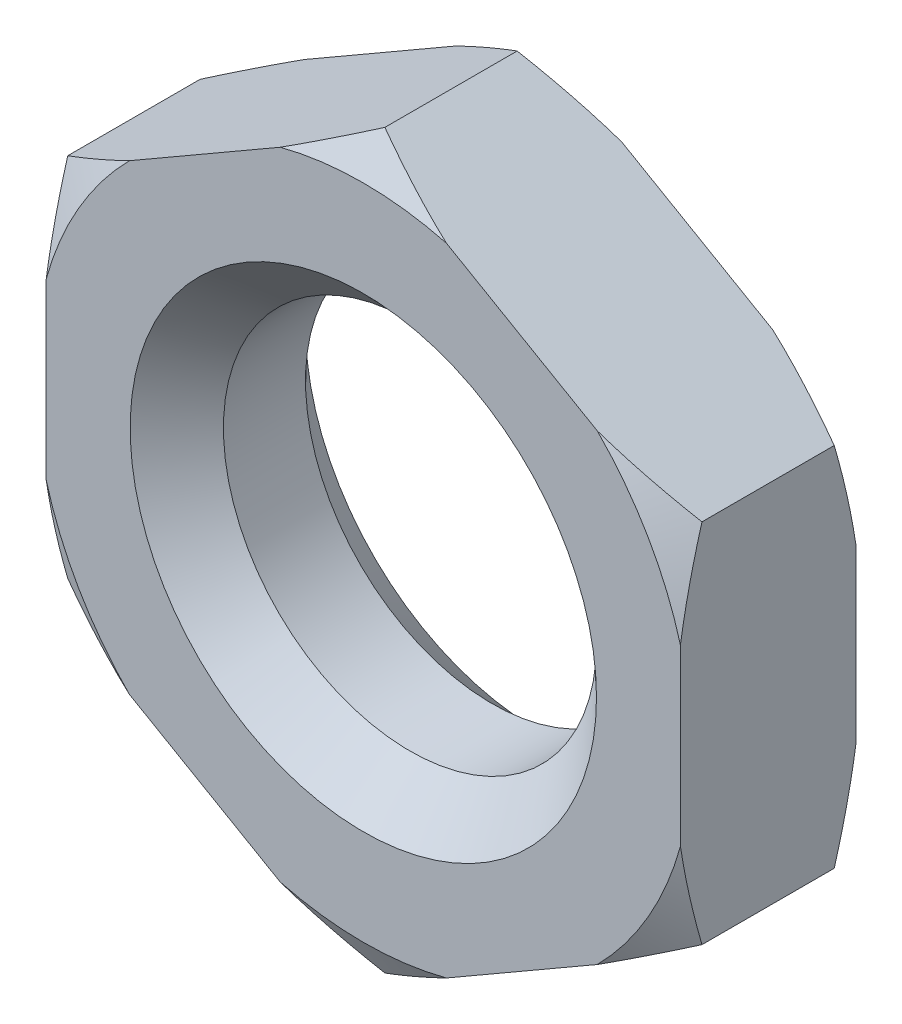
ISO-10303-21;
HEADER;
FILE_DESCRIPTION(('STEP AP214'),'2;1');
FILE_NAME('part.step','',(''),(''),'','','');
FILE_SCHEMA(('AUTOMOTIVE_DESIGN { 1 0 10303 214 1 1 1 1 }'));
ENDSEC;
DATA;
#1=APPLICATION_CONTEXT('core data for automotive mechanical design processes');
#2=APPLICATION_PROTOCOL_DEFINITION('international standard','automotive_design',2000,#1);
#3=PRODUCT_CONTEXT('',#1,'mechanical');
#4=PRODUCT('Part','Part','',(#3));
#5=PRODUCT_RELATED_PRODUCT_CATEGORY('part','',(#4));
#6=PRODUCT_DEFINITION_FORMATION('','',#4);
#7=PRODUCT_DEFINITION_CONTEXT('part definition',#1,'design');
#8=PRODUCT_DEFINITION('design','',#6,#7);
#9=PRODUCT_DEFINITION_SHAPE('','',#8);
#10=(LENGTH_UNIT() NAMED_UNIT(*) SI_UNIT(.MILLI.,.METRE.));
#11=(NAMED_UNIT(*) PLANE_ANGLE_UNIT() SI_UNIT($,.RADIAN.));
#12=(NAMED_UNIT(*) SI_UNIT($,.STERADIAN.) SOLID_ANGLE_UNIT());
#13=UNCERTAINTY_MEASURE_WITH_UNIT(LENGTH_MEASURE(1.E-05),#10,'distance_accuracy_value','');
#14=(GEOMETRIC_REPRESENTATION_CONTEXT(3) GLOBAL_UNCERTAINTY_ASSIGNED_CONTEXT((#13)) GLOBAL_UNIT_ASSIGNED_CONTEXT((#10,
#11,#12)) REPRESENTATION_CONTEXT('',''));
#15=CARTESIAN_POINT('',(0.,0.,0.));
#16=DIRECTION('',(0.,0.,1.));
#17=DIRECTION('',(1.,0.,0.));
#18=AXIS2_PLACEMENT_3D('',#15,#16,#17);
#19=CARTESIAN_POINT('',(0.,0.,-2.35));
#20=DIRECTION('',(0.,0.,1.));
#21=DIRECTION('',(1.,0.,0.));
#22=AXIS2_PLACEMENT_3D('',#19,#20,#21);
#23=PLANE('',#22);
#24=CARTESIAN_POINT('',(0.,0.,-2.35));
#25=DIRECTION('',(0.,0.,1.));
#26=DIRECTION('',(1.,0.,0.));
#27=AXIS2_PLACEMENT_3D('',#24,#25,#26);
#28=CIRCLE('',#27,6.25);
#29=CARTESIAN_POINT('',(6.25,0.,-2.35));
#30=VERTEX_POINT('',#29);
#31=EDGE_CURVE('E427',#30,#30,#28,.T.);
#32=ORIENTED_EDGE('',*,*,#31,.T.);
#33=EDGE_LOOP('',(#32));
#34=FACE_BOUND('',#33,.T.);
#35=DIRECTION('',(0.,1.,0.));
#36=VECTOR('',#35,1.);
#37=CARTESIAN_POINT('',(8.5,-4.90747728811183,-2.35));
#38=LINE('',#37,#36);
#39=CARTESIAN_POINT('',(8.5,-2.33525676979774,-2.35));
#40=VERTEX_POINT('',#39);
#41=CARTESIAN_POINT('',(8.5,2.33525676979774,-2.35));
#42=VERTEX_POINT('',#41);
#43=EDGE_CURVE('E361',#40,#42,#38,.T.);
#44=ORIENTED_EDGE('',*,*,#43,.F.);
#45=CARTESIAN_POINT('',(0.,0.,-2.35));
#46=DIRECTION('',(0.,0.,-1.));
#47=DIRECTION('',(-1.,0.,0.));
#48=AXIS2_PLACEMENT_3D('',#45,#46,#47);
#49=CIRCLE('',#48,8.81495457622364);
#50=CARTESIAN_POINT('',(6.27239168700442,-6.19358754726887,-2.35));
#51=VERTEX_POINT('',#50);
#52=EDGE_CURVE('E348',#40,#51,#49,.T.);
#53=ORIENTED_EDGE('',*,*,#52,.T.);
#54=DIRECTION('',(0.866025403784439,0.499999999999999,0.));
#55=VECTOR('',#54,1.);
#56=CARTESIAN_POINT('',(0.,-9.81495457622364,-2.35));
#57=LINE('',#56,#55);
#58=CARTESIAN_POINT('',(2.22760831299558,-8.52884431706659,-2.35));
#59=VERTEX_POINT('',#58);
#60=EDGE_CURVE('E372',#59,#51,#57,.T.);
#61=ORIENTED_EDGE('',*,*,#60,.F.);
#62=CARTESIAN_POINT('',(-2.2276083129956,-8.52884431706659,-2.35));
#63=VERTEX_POINT('',#62);
#64=EDGE_CURVE('E343',#59,#63,#49,.T.);
#65=ORIENTED_EDGE('',*,*,#64,.T.);
#66=DIRECTION('',(0.866025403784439,-0.5,0.));
#67=VECTOR('',#66,1.);
#68=CARTESIAN_POINT('',(-8.5,-4.90747728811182,-2.35));
#69=LINE('',#68,#67);
#70=CARTESIAN_POINT('',(-6.2723916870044,-6.19358754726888,-2.35));
#71=VERTEX_POINT('',#70);
#72=EDGE_CURVE('E380',#71,#63,#69,.T.);
#73=ORIENTED_EDGE('',*,*,#72,.F.);
#74=CARTESIAN_POINT('',(-8.5,-2.33525676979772,-2.35));
#75=VERTEX_POINT('',#74);
#76=EDGE_CURVE('E337',#71,#75,#49,.T.);
#77=ORIENTED_EDGE('',*,*,#76,.T.);
#78=DIRECTION('',(0.,-1.,0.));
#79=VECTOR('',#78,1.);
#80=CARTESIAN_POINT('',(-8.5,4.90747728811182,-2.35));
#81=LINE('',#80,#79);
#82=CARTESIAN_POINT('',(-8.5,2.33525676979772,-2.35));
#83=VERTEX_POINT('',#82);
#84=EDGE_CURVE('E473',#83,#75,#81,.T.);
#85=ORIENTED_EDGE('',*,*,#84,.F.);
#86=CARTESIAN_POINT('',(-6.27239168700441,6.19358754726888,-2.35));
#87=VERTEX_POINT('',#86);
#88=EDGE_CURVE('E62',#83,#87,#49,.T.);
#89=ORIENTED_EDGE('',*,*,#88,.T.);
#90=DIRECTION('',(-0.866025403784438,-0.5,0.));
#91=VECTOR('',#90,1.);
#92=CARTESIAN_POINT('',(0.,9.81495457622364,-2.35));
#93=LINE('',#92,#91);
#94=CARTESIAN_POINT('',(-2.2276083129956,8.52884431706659,-2.35));
#95=VERTEX_POINT('',#94);
#96=EDGE_CURVE('E180',#95,#87,#93,.T.);
#97=ORIENTED_EDGE('',*,*,#96,.F.);
#98=CARTESIAN_POINT('',(2.22760831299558,8.52884431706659,-2.35));
#99=VERTEX_POINT('',#98);
#100=EDGE_CURVE('E54',#95,#99,#49,.T.);
#101=ORIENTED_EDGE('',*,*,#100,.T.);
#102=DIRECTION('',(-0.866025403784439,0.5,0.));
#103=VECTOR('',#102,1.);
#104=CARTESIAN_POINT('',(8.5,4.90747728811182,-2.35));
#105=LINE('',#104,#103);
#106=CARTESIAN_POINT('',(6.27239168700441,6.19358754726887,-2.35));
#107=VERTEX_POINT('',#106);
#108=EDGE_CURVE('E362',#107,#99,#105,.T.);
#109=ORIENTED_EDGE('',*,*,#108,.F.);
#110=EDGE_CURVE('E341',#107,#42,#49,.T.);
#111=ORIENTED_EDGE('',*,*,#110,.T.);
#112=EDGE_LOOP('',(#44,#53,#61,#65,#73,#77,#85,#89,#97,#101,#109,#111));
#113=FACE_BOUND('',#112,.T.);
#114=ADVANCED_FACE('F38',(#34,#113),#23,.F.);
#115=CARTESIAN_POINT('',(0.,0.,2.35));
#116=DIRECTION('',(0.,0.,1.));
#117=DIRECTION('',(1.,0.,0.));
#118=AXIS2_PLACEMENT_3D('',#115,#116,#117);
#119=PLANE('',#118);
#120=CARTESIAN_POINT('',(0.,0.,2.35));
#121=DIRECTION('',(0.,0.,1.));
#122=DIRECTION('',(1.,0.,0.));
#123=AXIS2_PLACEMENT_3D('',#120,#121,#122);
#124=CIRCLE('',#123,6.25000000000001);
#125=CARTESIAN_POINT('',(6.25000000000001,0.,2.35));
#126=VERTEX_POINT('',#125);
#127=EDGE_CURVE('E11',#126,#126,#124,.F.);
#128=ORIENTED_EDGE('',*,*,#127,.T.);
#129=EDGE_LOOP('',(#128));
#130=FACE_BOUND('',#129,.T.);
#131=CARTESIAN_POINT('',(0.,0.,2.35));
#132=DIRECTION('',(0.,0.,-1.));
#133=DIRECTION('',(-1.,0.,0.));
#134=AXIS2_PLACEMENT_3D('',#131,#132,#133);
#135=CIRCLE('',#134,8.81495457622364);
#136=CARTESIAN_POINT('',(8.5,-2.33525676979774,2.35));
#137=VERTEX_POINT('',#136);
#138=CARTESIAN_POINT('',(6.27239168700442,-6.19358754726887,2.35));
#139=VERTEX_POINT('',#138);
#140=EDGE_CURVE('E314',#137,#139,#135,.T.);
#141=ORIENTED_EDGE('',*,*,#140,.F.);
#142=DIRECTION('',(0.,1.,0.));
#143=VECTOR('',#142,1.);
#144=CARTESIAN_POINT('',(8.5,-4.90747728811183,2.35));
#145=LINE('',#144,#143);
#146=CARTESIAN_POINT('',(8.5,2.33525676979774,2.35));
#147=VERTEX_POINT('',#146);
#148=EDGE_CURVE('E388',#137,#147,#145,.T.);
#149=ORIENTED_EDGE('',*,*,#148,.T.);
#150=CARTESIAN_POINT('',(6.27239168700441,6.19358754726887,2.35));
#151=VERTEX_POINT('',#150);
#152=EDGE_CURVE('E305',#151,#147,#135,.T.);
#153=ORIENTED_EDGE('',*,*,#152,.F.);
#154=DIRECTION('',(-0.866025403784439,0.5,0.));
#155=VECTOR('',#154,1.);
#156=CARTESIAN_POINT('',(8.5,4.90747728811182,2.35));
#157=LINE('',#156,#155);
#158=CARTESIAN_POINT('',(2.22760831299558,8.52884431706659,2.35));
#159=VERTEX_POINT('',#158);
#160=EDGE_CURVE('E371',#151,#159,#157,.T.);
#161=ORIENTED_EDGE('',*,*,#160,.T.);
#162=CARTESIAN_POINT('',(-2.2276083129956,8.52884431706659,2.35));
#163=VERTEX_POINT('',#162);
#164=EDGE_CURVE('E295',#163,#159,#135,.T.);
#165=ORIENTED_EDGE('',*,*,#164,.F.);
#166=DIRECTION('',(-0.866025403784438,-0.5,0.));
#167=VECTOR('',#166,1.);
#168=CARTESIAN_POINT('',(0.,9.81495457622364,2.35));
#169=LINE('',#168,#167);
#170=CARTESIAN_POINT('',(-6.27239168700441,6.19358754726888,2.35));
#171=VERTEX_POINT('',#170);
#172=EDGE_CURVE('E378',#163,#171,#169,.T.);
#173=ORIENTED_EDGE('',*,*,#172,.T.);
#174=CARTESIAN_POINT('',(-8.5,2.33525676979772,2.35));
#175=VERTEX_POINT('',#174);
#176=EDGE_CURVE('E293',#175,#171,#135,.T.);
#177=ORIENTED_EDGE('',*,*,#176,.F.);
#178=DIRECTION('',(0.,-1.,0.));
#179=VECTOR('',#178,1.);
#180=CARTESIAN_POINT('',(-8.5,4.90747728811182,2.35));
#181=LINE('',#180,#179);
#182=CARTESIAN_POINT('',(-8.5,-2.33525676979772,2.35));
#183=VERTEX_POINT('',#182);
#184=EDGE_CURVE('E476',#175,#183,#181,.T.);
#185=ORIENTED_EDGE('',*,*,#184,.T.);
#186=CARTESIAN_POINT('',(-6.27239168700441,-6.19358754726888,2.35));
#187=VERTEX_POINT('',#186);
#188=EDGE_CURVE('E296',#187,#183,#135,.T.);
#189=ORIENTED_EDGE('',*,*,#188,.F.);
#190=DIRECTION('',(0.866025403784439,-0.5,0.));
#191=VECTOR('',#190,1.);
#192=CARTESIAN_POINT('',(-8.5,-4.90747728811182,2.35));
#193=LINE('',#192,#191);
#194=CARTESIAN_POINT('',(-2.2276083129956,-8.52884431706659,2.35));
#195=VERTEX_POINT('',#194);
#196=EDGE_CURVE('E466',#187,#195,#193,.T.);
#197=ORIENTED_EDGE('',*,*,#196,.T.);
#198=CARTESIAN_POINT('',(2.22760831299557,-8.52884431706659,2.35));
#199=VERTEX_POINT('',#198);
#200=EDGE_CURVE('E307',#199,#195,#135,.T.);
#201=ORIENTED_EDGE('',*,*,#200,.F.);
#202=DIRECTION('',(0.866025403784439,0.499999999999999,0.));
#203=VECTOR('',#202,1.);
#204=CARTESIAN_POINT('',(0.,-9.81495457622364,2.35));
#205=LINE('',#204,#203);
#206=EDGE_CURVE('E462',#199,#139,#205,.T.);
#207=ORIENTED_EDGE('',*,*,#206,.T.);
#208=EDGE_LOOP('',(#141,#149,#153,#161,#165,#173,#177,#185,#189,#197,#201,#207));
#209=FACE_BOUND('',#208,.T.);
#210=ADVANCED_FACE('F418',(#130,#209),#119,.T.);
#211=CARTESIAN_POINT('',(8.5,4.90747728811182,2.35));
#212=DIRECTION('',(-0.5,-0.866025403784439,0.));
#213=DIRECTION('',(0.866025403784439,-0.5,0.));
#214=AXIS2_PLACEMENT_3D('',#211,#212,#213);
#215=PLANE('',#214);
#216=DIRECTION('',(0.,0.,-1.));
#217=VECTOR('',#216,1.);
#218=CARTESIAN_POINT('',(8.5,4.90747728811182,2.35));
#219=LINE('',#218,#217);
#220=CARTESIAN_POINT('',(8.5,4.90747728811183,1.77264973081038));
#221=VERTEX_POINT('',#220);
#222=CARTESIAN_POINT('',(8.5,4.90747728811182,-1.77264973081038));
#223=VERTEX_POINT('',#222);
#224=EDGE_CURVE('E384',#221,#223,#219,.T.);
#225=ORIENTED_EDGE('',*,*,#224,.T.);
#226=CARTESIAN_POINT('',(14.399352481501,1.50148454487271,0.919228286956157));
#227=CARTESIAN_POINT('',(14.1323061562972,1.65566381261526,0.775143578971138));
#228=CARTESIAN_POINT('',(13.8646205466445,1.81021217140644,0.632614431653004));
#229=CARTESIAN_POINT('',(13.3277011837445,2.12020271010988,0.35139780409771));
#230=CARTESIAN_POINT('',(13.0584672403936,2.27564499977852,0.212710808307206));
#231=CARTESIAN_POINT('',(12.5173808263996,2.58804138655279,-0.0604925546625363));
#232=CARTESIAN_POINT('',(12.2455227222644,2.7449987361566,-0.194994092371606));
#233=CARTESIAN_POINT('',(11.6997690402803,3.06008977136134,-0.458355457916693));
#234=CARTESIAN_POINT('',(11.4258735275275,3.21822341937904,-0.587215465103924));
#235=CARTESIAN_POINT('',(10.8687339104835,3.53988812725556,-0.841243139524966));
#236=CARTESIAN_POINT('',(10.5854290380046,3.70345427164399,-0.966233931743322));
#237=CARTESIAN_POINT('',(10.0159609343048,4.03223683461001,-1.20730558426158));
#238=CARTESIAN_POINT('',(9.72979756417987,4.19745333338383,-1.32338600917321));
#239=CARTESIAN_POINT('',(9.15454636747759,4.52957476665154,-1.54442576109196));
#240=CARTESIAN_POINT('',(8.8654616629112,4.69647789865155,-1.64939581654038));
#241=CARTESIAN_POINT('',(8.28389822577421,5.03224370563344,-1.84579039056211));
#242=CARTESIAN_POINT('',(7.99141993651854,5.20110612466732,-1.93721665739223));
#243=CARTESIAN_POINT('',(7.29191866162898,5.6049633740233,-2.1349622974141));
#244=CARTESIAN_POINT('',(6.88326573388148,5.84089925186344,-2.23391032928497));
#245=CARTESIAN_POINT('',(6.26611138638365,6.19721348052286,-2.35280449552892));
#246=CARTESIAN_POINT('',(6.05970744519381,6.31638085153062,-2.38751361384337));
#247=CARTESIAN_POINT('',(5.64574324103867,6.55538319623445,-2.44622187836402));
#248=CARTESIAN_POINT('',(5.438182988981,6.67521816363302,-2.47022112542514));
#249=CARTESIAN_POINT('',(5.02471822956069,6.91393215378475,-2.50660542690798));
#250=CARTESIAN_POINT('',(4.8188224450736,7.03280614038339,-2.51912197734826));
#251=CARTESIAN_POINT('',(4.40674655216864,7.27071826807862,-2.53264400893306));
#252=CARTESIAN_POINT('',(4.20056644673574,7.38975640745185,-2.53364961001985));
#253=CARTESIAN_POINT('',(3.78840865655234,7.62771581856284,-2.52411772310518));
#254=CARTESIAN_POINT('',(3.5824309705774,7.74663709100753,-2.513580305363));
#255=CARTESIAN_POINT('',(3.17111495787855,7.98411050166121,-2.48128123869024));
#256=CARTESIAN_POINT('',(2.9657767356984,8.10266257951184,-2.45951784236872));
#257=CARTESIAN_POINT('',(2.48062586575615,8.38276456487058,-2.3953873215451));
#258=CARTESIAN_POINT('',(2.20126952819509,8.54405102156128,-2.34838202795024));
#259=CARTESIAN_POINT('',(1.64523215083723,8.86507935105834,-2.23667031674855));
#260=CARTESIAN_POINT('',(1.36855150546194,9.02482099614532,-2.17196132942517));
#261=CARTESIAN_POINT('',(0.81789881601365,9.34274047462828,-2.02728510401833));
#262=CARTESIAN_POINT('',(0.543930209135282,9.50091632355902,-1.9473006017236));
#263=CARTESIAN_POINT('',(-0.000931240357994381,9.81549222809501,-1.77459301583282));
#264=CARTESIAN_POINT('',(-0.271824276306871,9.97189239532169,-1.68187073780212));
#265=CARTESIAN_POINT('',(-0.813928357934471,10.2848763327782,-1.48472368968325));
#266=CARTESIAN_POINT('',(-1.08510471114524,10.4414400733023,-1.3801726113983));
#267=CARTESIAN_POINT('',(-1.62458458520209,10.7529089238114,-1.16229593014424));
#268=CARTESIAN_POINT('',(-1.89288988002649,10.9078150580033,-1.0489761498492));
#269=CARTESIAN_POINT('',(-2.42705527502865,11.2162155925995,-0.815117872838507));
#270=CARTESIAN_POINT('',(-2.69291587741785,11.3697102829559,-0.694580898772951));
#271=CARTESIAN_POINT('',(-3.22255292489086,11.6754963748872,-0.447551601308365));
#272=CARTESIAN_POINT('',(-3.48632933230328,11.8277877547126,-0.321059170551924));
#273=CARTESIAN_POINT('',(-3.9308458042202,12.0844294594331,-0.102994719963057));
#274=CARTESIAN_POINT('',(-4.11206097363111,12.1890540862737,-0.0127085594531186));
#275=CARTESIAN_POINT('',(-4.47370041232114,12.397846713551,0.169932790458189));
#276=CARTESIAN_POINT('',(-4.6541247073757,12.5020147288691,0.262287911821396));
#277=CARTESIAN_POINT('',(-5.01237142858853,12.7088485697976,0.447844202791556));
#278=CARTESIAN_POINT('',(-5.19020127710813,12.8115186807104,0.541026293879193));
#279=CARTESIAN_POINT('',(-5.54523277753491,13.0164962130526,0.728982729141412));
#280=CARTESIAN_POINT('',(-5.72243441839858,13.118803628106,0.823757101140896));
#281=CARTESIAN_POINT('',(-5.89935248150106,13.2209473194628,0.919228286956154));
#282=B_SPLINE_CURVE_WITH_KNOTS('',3,(#226,#227,#228,#229,#230,#231,#232,#233,#234,#235,#236,
#237,#238,#239,#240,#241,#242,#243,#244,#245,#246,#247,#248,#249,#250,#251,#252,#253,#254,#255,
#256,#257,#258,#259,#260,#261,#262,#263,#264,#265,#266,#267,#268,#269,#270,#271,#272,#273,#274,
#275,#276,#277,#278,#279,#280,#281),.UNSPECIFIED.,.F.,.F.,(4,2,2,2,2,2,2,2,2,2,2,2,2,2,2,2,2,2,
2,2,2,2,2,2,2,2,2,4),(0.,1.02109297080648,2.04231410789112,3.06681592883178,4.09128515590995,
5.14177132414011,6.19230878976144,7.24182239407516,8.29120040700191,9.73603308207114,
10.4583801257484,11.1807203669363,11.894681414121,12.6086350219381,13.3225842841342,
14.0366447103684,15.0139923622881,15.9914819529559,16.970082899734,17.9486219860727,
18.9388241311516,19.9283743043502,20.9177164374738,21.9070764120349,22.5907552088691,
23.274411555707,23.9508863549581,24.6273729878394),.UNSPECIFIED.);
#283=EDGE_CURVE('E318',#223,#107,#282,.T.);
#284=ORIENTED_EDGE('',*,*,#283,.T.);
#285=ORIENTED_EDGE('',*,*,#108,.T.);
#286=CARTESIAN_POINT('',(0.,9.81495457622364,-1.77264973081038));
#287=VERTEX_POINT('',#286);
#288=EDGE_CURVE('E308',#99,#287,#282,.T.);
#289=ORIENTED_EDGE('',*,*,#288,.T.);
#290=DIRECTION('',(0.,0.,-1.));
#291=VECTOR('',#290,1.);
#292=CARTESIAN_POINT('',(0.,9.81495457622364,2.35));
#293=LINE('',#292,#291);
#294=CARTESIAN_POINT('',(0.,9.81495457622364,1.77264973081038));
#295=VERTEX_POINT('',#294);
#296=EDGE_CURVE('E189',#295,#287,#293,.T.);
#297=ORIENTED_EDGE('',*,*,#296,.F.);
#298=CARTESIAN_POINT('',(-5.89935248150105,13.2209473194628,-0.91922828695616));
#299=CARTESIAN_POINT('',(-5.63230615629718,13.0667680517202,-0.775143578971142));
#300=CARTESIAN_POINT('',(-5.36462054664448,12.912219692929,-0.632614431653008));
#301=CARTESIAN_POINT('',(-4.82770118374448,12.6022291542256,-0.351397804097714));
#302=CARTESIAN_POINT('',(-4.55846724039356,12.446786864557,-0.21271080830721));
#303=CARTESIAN_POINT('',(-4.01738082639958,12.1343904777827,0.0604925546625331));
#304=CARTESIAN_POINT('',(-3.74552272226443,11.9774331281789,0.194994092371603));
#305=CARTESIAN_POINT('',(-3.19976904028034,11.6623420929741,0.458355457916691));
#306=CARTESIAN_POINT('',(-2.92587352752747,11.5042084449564,0.587215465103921));
#307=CARTESIAN_POINT('',(-2.36873391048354,11.1825437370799,0.841243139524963));
#308=CARTESIAN_POINT('',(-2.08542903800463,11.0189775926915,0.96623393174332));
#309=CARTESIAN_POINT('',(-1.51596093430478,10.6901950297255,1.20730558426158));
#310=CARTESIAN_POINT('',(-1.22979756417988,10.5249785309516,1.32338600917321));
#311=CARTESIAN_POINT('',(-0.654546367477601,10.1928570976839,1.54442576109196));
#312=CARTESIAN_POINT('',(-0.365461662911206,10.0259539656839,1.64939581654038));
#313=CARTESIAN_POINT('',(0.216101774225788,9.69018815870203,1.84579039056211));
#314=CARTESIAN_POINT('',(0.508580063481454,9.52132573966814,1.93721665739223));
#315=CARTESIAN_POINT('',(1.20808133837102,9.11746849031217,2.1349622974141));
#316=CARTESIAN_POINT('',(1.61673426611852,8.88153261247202,2.23391032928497));
#317=CARTESIAN_POINT('',(2.23388861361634,8.52521838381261,2.35280449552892));
#318=CARTESIAN_POINT('',(2.44029255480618,8.40605101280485,2.38751361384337));
#319=CARTESIAN_POINT('',(2.85425675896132,8.16704866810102,2.44622187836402));
#320=CARTESIAN_POINT('',(3.06181701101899,8.04721370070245,2.47022112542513));
#321=CARTESIAN_POINT('',(3.4752817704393,7.80849971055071,2.50660542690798));
#322=CARTESIAN_POINT('',(3.68117755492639,7.68962572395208,2.51912197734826));
#323=CARTESIAN_POINT('',(4.09325344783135,7.45171359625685,2.53264400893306));
#324=CARTESIAN_POINT('',(4.29943355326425,7.33267545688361,2.53364961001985));
#325=CARTESIAN_POINT('',(4.71159134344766,7.09471604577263,2.52411772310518));
#326=CARTESIAN_POINT('',(4.91756902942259,6.97579477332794,2.513580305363));
#327=CARTESIAN_POINT('',(5.32888504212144,6.73832136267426,2.48128123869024));
#328=CARTESIAN_POINT('',(5.5342232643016,6.61976928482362,2.45951784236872));
#329=CARTESIAN_POINT('',(6.01937413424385,6.33966729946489,2.3953873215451));
#330=CARTESIAN_POINT('',(6.2987304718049,6.17838084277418,2.34838202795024));
#331=CARTESIAN_POINT('',(6.85476784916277,5.85735251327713,2.23667031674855));
#332=CARTESIAN_POINT('',(7.13144849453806,5.69761086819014,2.17196132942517));
#333=CARTESIAN_POINT('',(7.68210118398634,5.37969138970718,2.02728510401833));
#334=CARTESIAN_POINT('',(7.95606979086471,5.22151554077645,1.94730060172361));
#335=CARTESIAN_POINT('',(8.50093124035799,4.90693963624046,1.77459301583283));
#336=CARTESIAN_POINT('',(8.77182427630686,4.75053946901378,1.68187073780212));
#337=CARTESIAN_POINT('',(9.31392835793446,4.43755553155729,1.48472368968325));
#338=CARTESIAN_POINT('',(9.58510471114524,4.28099179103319,1.3801726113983));
#339=CARTESIAN_POINT('',(10.1245845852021,3.96952294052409,1.16229593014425));
#340=CARTESIAN_POINT('',(10.3928898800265,3.81461680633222,1.0489761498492));
#341=CARTESIAN_POINT('',(10.9270552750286,3.50621627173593,0.815117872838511));
#342=CARTESIAN_POINT('',(11.1929158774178,3.35272158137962,0.694580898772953));
#343=CARTESIAN_POINT('',(11.7225529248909,3.04693548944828,0.447551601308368));
#344=CARTESIAN_POINT('',(11.9863293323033,2.89464410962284,0.321059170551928));
#345=CARTESIAN_POINT('',(12.4308458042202,2.63800240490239,0.102994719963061));
#346=CARTESIAN_POINT('',(12.6120609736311,2.53337777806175,0.0127085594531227));
#347=CARTESIAN_POINT('',(12.9737004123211,2.32458515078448,-0.169932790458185));
#348=CARTESIAN_POINT('',(13.1541247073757,2.22041713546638,-0.262287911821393));
#349=CARTESIAN_POINT('',(13.5123714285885,2.01358329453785,-0.447844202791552));
#350=CARTESIAN_POINT('',(13.6902012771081,1.91091318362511,-0.541026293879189));
#351=CARTESIAN_POINT('',(14.0452327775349,1.70593565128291,-0.728982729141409));
#352=CARTESIAN_POINT('',(14.2224344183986,1.60362823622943,-0.823757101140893));
#353=CARTESIAN_POINT('',(14.399352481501,1.50148454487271,-0.919228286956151));
#354=B_SPLINE_CURVE_WITH_KNOTS('',3,(#298,#299,#300,#301,#302,#303,#304,#305,#306,#307,#308,
#309,#310,#311,#312,#313,#314,#315,#316,#317,#318,#319,#320,#321,#322,#323,#324,#325,#326,#327,
#328,#329,#330,#331,#332,#333,#334,#335,#336,#337,#338,#339,#340,#341,#342,#343,#344,#345,#346,
#347,#348,#349,#350,#351,#352,#353),.UNSPECIFIED.,.F.,.F.,(4,2,2,2,2,2,2,2,2,2,2,2,2,2,2,2,2,2,
2,2,2,2,2,2,2,2,2,4),(0.,1.02109297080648,2.04231410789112,3.06681592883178,4.09128515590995,
5.14177132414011,6.19230878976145,7.24182239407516,8.29120040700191,9.73603308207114,
10.4583801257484,11.1807203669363,11.894681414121,12.6086350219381,13.3225842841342,
14.0366447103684,15.0139923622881,15.9914819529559,16.9700828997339,17.9486219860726,
18.9388241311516,19.9283743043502,20.9177164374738,21.9070764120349,22.5907552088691,
23.274411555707,23.9508863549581,24.6273729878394),.UNSPECIFIED.);
#355=EDGE_CURVE('E471',#295,#159,#354,.T.);
#356=ORIENTED_EDGE('',*,*,#355,.T.);
#357=ORIENTED_EDGE('',*,*,#160,.F.);
#358=EDGE_CURVE('E247',#151,#221,#354,.T.);
#359=ORIENTED_EDGE('',*,*,#358,.T.);
#360=EDGE_LOOP('',(#225,#284,#285,#289,#297,#356,#357,#359));
#361=FACE_BOUND('',#360,.T.);
#362=ADVANCED_FACE('F423',(#361),#215,.F.);
#363=CARTESIAN_POINT('',(0.,9.81495457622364,2.35));
#364=DIRECTION('',(0.5,-0.866025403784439,0.));
#365=DIRECTION('',(0.866025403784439,0.5,0.));
#366=AXIS2_PLACEMENT_3D('',#363,#364,#365);
#367=PLANE('',#366);
#368=ORIENTED_EDGE('',*,*,#296,.T.);
#369=CARTESIAN_POINT('',(5.89935248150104,13.2209473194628,0.919228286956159));
#370=CARTESIAN_POINT('',(5.63230615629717,13.0667680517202,0.77514357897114));
#371=CARTESIAN_POINT('',(5.36462054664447,12.912219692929,0.632614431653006));
#372=CARTESIAN_POINT('',(4.82770118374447,12.6022291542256,0.351397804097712));
#373=CARTESIAN_POINT('',(4.55846724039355,12.446786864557,0.212710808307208));
#374=CARTESIAN_POINT('',(4.01738082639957,12.1343904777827,-0.0604925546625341));
#375=CARTESIAN_POINT('',(3.74552272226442,11.9774331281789,-0.194994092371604));
#376=CARTESIAN_POINT('',(3.19976904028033,11.6623420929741,-0.458355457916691));
#377=CARTESIAN_POINT('',(2.92587352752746,11.5042084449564,-0.587215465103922));
#378=CARTESIAN_POINT('',(2.36873391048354,11.1825437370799,-0.841243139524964));
#379=CARTESIAN_POINT('',(2.08542903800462,11.0189775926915,-0.96623393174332));
#380=CARTESIAN_POINT('',(1.51596093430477,10.6901950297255,-1.20730558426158));
#381=CARTESIAN_POINT('',(1.22979756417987,10.5249785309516,-1.32338600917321));
#382=CARTESIAN_POINT('',(0.654546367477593,10.1928570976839,-1.54442576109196));
#383=CARTESIAN_POINT('',(0.365461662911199,10.0259539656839,-1.64939581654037));
#384=CARTESIAN_POINT('',(-0.216101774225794,9.69018815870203,-1.84579039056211));
#385=CARTESIAN_POINT('',(-0.508580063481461,9.52132573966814,-1.93721665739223));
#386=CARTESIAN_POINT('',(-1.20808133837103,9.11746849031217,-2.1349622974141));
#387=CARTESIAN_POINT('',(-1.61673426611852,8.88153261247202,-2.23391032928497));
#388=CARTESIAN_POINT('',(-2.23388861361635,8.5252183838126,-2.35280449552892));
#389=CARTESIAN_POINT('',(-2.44029255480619,8.40605101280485,-2.38751361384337));
#390=CARTESIAN_POINT('',(-2.85425675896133,8.16704866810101,-2.44622187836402));
#391=CARTESIAN_POINT('',(-3.061817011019,8.04721370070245,-2.47022112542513));
#392=CARTESIAN_POINT('',(-3.47528177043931,7.80849971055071,-2.50660542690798));
#393=CARTESIAN_POINT('',(-3.6811775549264,7.68962572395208,-2.51912197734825));
#394=CARTESIAN_POINT('',(-4.09325344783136,7.45171359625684,-2.53264400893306));
#395=CARTESIAN_POINT('',(-4.29943355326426,7.33267545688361,-2.53364961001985));
#396=CARTESIAN_POINT('',(-4.71159134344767,7.09471604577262,-2.52411772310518));
#397=CARTESIAN_POINT('',(-4.9175690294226,6.97579477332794,-2.513580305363));
#398=CARTESIAN_POINT('',(-5.32888504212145,6.73832136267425,-2.48128123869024));
#399=CARTESIAN_POINT('',(-5.53422326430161,6.61976928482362,-2.45951784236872));
#400=CARTESIAN_POINT('',(-6.01937413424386,6.33966729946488,-2.39538732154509));
#401=CARTESIAN_POINT('',(-6.29873047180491,6.17838084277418,-2.34838202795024));
#402=CARTESIAN_POINT('',(-6.85476784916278,5.85735251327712,-2.23667031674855));
#403=CARTESIAN_POINT('',(-7.13144849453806,5.69761086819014,-2.17196132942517));
#404=CARTESIAN_POINT('',(-7.68210118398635,5.37969138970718,-2.02728510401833));
#405=CARTESIAN_POINT('',(-7.95606979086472,5.22151554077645,-1.9473006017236));
#406=CARTESIAN_POINT('',(-8.500931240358,4.90693963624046,-1.77459301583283));
#407=CARTESIAN_POINT('',(-8.77182427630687,4.75053946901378,-1.68187073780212));
#408=CARTESIAN_POINT('',(-9.31392835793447,4.43755553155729,-1.48472368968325));
#409=CARTESIAN_POINT('',(-9.58510471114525,4.28099179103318,-1.3801726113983));
#410=CARTESIAN_POINT('',(-10.1245845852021,3.96952294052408,-1.16229593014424));
#411=CARTESIAN_POINT('',(-10.3928898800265,3.81461680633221,-1.0489761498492));
#412=CARTESIAN_POINT('',(-10.9270552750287,3.50621627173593,-0.815117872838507));
#413=CARTESIAN_POINT('',(-11.1929158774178,3.35272158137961,-0.694580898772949));
#414=CARTESIAN_POINT('',(-11.7225529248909,3.04693548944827,-0.447551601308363));
#415=CARTESIAN_POINT('',(-11.9863293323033,2.89464410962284,-0.321059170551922));
#416=CARTESIAN_POINT('',(-12.4308458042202,2.63800240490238,-0.102994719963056));
#417=CARTESIAN_POINT('',(-12.6120609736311,2.53337777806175,-0.0127085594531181));
#418=CARTESIAN_POINT('',(-12.9737004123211,2.32458515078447,0.16993279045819));
#419=CARTESIAN_POINT('',(-13.1541247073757,2.22041713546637,0.262287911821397));
#420=CARTESIAN_POINT('',(-13.5123714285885,2.01358329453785,0.447844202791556));
#421=CARTESIAN_POINT('',(-13.6902012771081,1.9109131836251,0.541026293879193));
#422=CARTESIAN_POINT('',(-14.0452327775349,1.70593565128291,0.728982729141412));
#423=CARTESIAN_POINT('',(-14.2224344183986,1.60362823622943,0.823757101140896));
#424=CARTESIAN_POINT('',(-14.3993524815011,1.5014845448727,0.919228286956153));
#425=B_SPLINE_CURVE_WITH_KNOTS('',3,(#369,#370,#371,#372,#373,#374,#375,#376,#377,#378,#379,
#380,#381,#382,#383,#384,#385,#386,#387,#388,#389,#390,#391,#392,#393,#394,#395,#396,#397,#398,
#399,#400,#401,#402,#403,#404,#405,#406,#407,#408,#409,#410,#411,#412,#413,#414,#415,#416,#417,
#418,#419,#420,#421,#422,#423,#424),.UNSPECIFIED.,.F.,.F.,(4,2,2,2,2,2,2,2,2,2,2,2,2,2,2,2,2,2,
2,2,2,2,2,2,2,2,2,4),(0.,1.02109297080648,2.04231410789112,3.06681592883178,4.09128515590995,
5.14177132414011,6.19230878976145,7.24182239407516,8.29120040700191,9.73603308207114,
10.4583801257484,11.1807203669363,11.894681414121,12.6086350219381,13.3225842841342,
14.0366447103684,15.0139923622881,15.9914819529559,16.970082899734,17.9486219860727,
18.9388241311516,19.9283743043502,20.9177164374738,21.9070764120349,22.5907552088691,
23.274411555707,23.9508863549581,24.6273729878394),.UNSPECIFIED.);
#426=EDGE_CURVE('E182',#287,#95,#425,.T.);
#427=ORIENTED_EDGE('',*,*,#426,.T.);
#428=ORIENTED_EDGE('',*,*,#96,.T.);
#429=CARTESIAN_POINT('',(-8.5,4.90747728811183,-1.77264973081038));
#430=VERTEX_POINT('',#429);
#431=EDGE_CURVE('E164',#87,#430,#425,.T.);
#432=ORIENTED_EDGE('',*,*,#431,.T.);
#433=DIRECTION('',(0.,0.,-1.));
#434=VECTOR('',#433,1.);
#435=CARTESIAN_POINT('',(-8.5,4.90747728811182,2.35));
#436=LINE('',#435,#434);
#437=CARTESIAN_POINT('',(-8.5,4.90747728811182,1.77264973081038));
#438=VERTEX_POINT('',#437);
#439=EDGE_CURVE('E178',#438,#430,#436,.T.);
#440=ORIENTED_EDGE('',*,*,#439,.F.);
#441=CARTESIAN_POINT('',(-14.399352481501,1.5014845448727,-0.919228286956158));
#442=CARTESIAN_POINT('',(-14.1323061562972,1.65566381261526,-0.77514357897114));
#443=CARTESIAN_POINT('',(-13.8646205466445,1.81021217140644,-0.632614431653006));
#444=CARTESIAN_POINT('',(-13.3277011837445,2.12020271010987,-0.351397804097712));
#445=CARTESIAN_POINT('',(-13.0584672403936,2.27564499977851,-0.212710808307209));
#446=CARTESIAN_POINT('',(-12.5173808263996,2.58804138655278,0.0604925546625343));
#447=CARTESIAN_POINT('',(-12.2455227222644,2.7449987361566,0.194994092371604));
#448=CARTESIAN_POINT('',(-11.6997690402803,3.06008977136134,0.458355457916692));
#449=CARTESIAN_POINT('',(-11.4258735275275,3.21822341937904,0.587215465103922));
#450=CARTESIAN_POINT('',(-10.8687339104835,3.53988812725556,0.841243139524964));
#451=CARTESIAN_POINT('',(-10.5854290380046,3.70345427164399,0.966233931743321));
#452=CARTESIAN_POINT('',(-10.0159609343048,4.03223683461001,1.20730558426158));
#453=CARTESIAN_POINT('',(-9.72979756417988,4.19745333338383,1.32338600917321));
#454=CARTESIAN_POINT('',(-9.1545463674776,4.52957476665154,1.54442576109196));
#455=CARTESIAN_POINT('',(-8.8654616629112,4.69647789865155,1.64939581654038));
#456=CARTESIAN_POINT('',(-8.28389822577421,5.03224370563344,1.84579039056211));
#457=CARTESIAN_POINT('',(-7.99141993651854,5.20110612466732,1.93721665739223));
#458=CARTESIAN_POINT('',(-7.29191866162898,5.6049633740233,2.1349622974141));
#459=CARTESIAN_POINT('',(-6.88326573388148,5.84089925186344,2.23391032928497));
#460=CARTESIAN_POINT('',(-6.26611138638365,6.19721348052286,2.35280449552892));
#461=CARTESIAN_POINT('',(-6.05970744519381,6.31638085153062,2.38751361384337));
#462=CARTESIAN_POINT('',(-5.64574324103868,6.55538319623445,2.44622187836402));
#463=CARTESIAN_POINT('',(-5.438182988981,6.67521816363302,2.47022112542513));
#464=CARTESIAN_POINT('',(-5.02471822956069,6.91393215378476,2.50660542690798));
#465=CARTESIAN_POINT('',(-4.8188224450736,7.03280614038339,2.51912197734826));
#466=CARTESIAN_POINT('',(-4.40674655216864,7.27071826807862,2.53264400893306));
#467=CARTESIAN_POINT('',(-4.20056644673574,7.38975640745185,2.53364961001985));
#468=CARTESIAN_POINT('',(-3.78840865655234,7.62771581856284,2.52411772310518));
#469=CARTESIAN_POINT('',(-3.5824309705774,7.74663709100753,2.513580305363));
#470=CARTESIAN_POINT('',(-3.17111495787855,7.98411050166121,2.48128123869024));
#471=CARTESIAN_POINT('',(-2.9657767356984,8.10266257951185,2.45951784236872));
#472=CARTESIAN_POINT('',(-2.48062586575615,8.38276456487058,2.39538732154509));
#473=CARTESIAN_POINT('',(-2.20126952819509,8.54405102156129,2.34838202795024));
#474=CARTESIAN_POINT('',(-1.64523215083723,8.86507935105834,2.23667031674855));
#475=CARTESIAN_POINT('',(-1.36855150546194,9.02482099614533,2.17196132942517));
#476=CARTESIAN_POINT('',(-0.817898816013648,9.34274047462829,2.02728510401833));
#477=CARTESIAN_POINT('',(-0.54393020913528,9.50091632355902,1.9473006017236));
#478=CARTESIAN_POINT('',(0.000931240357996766,9.81549222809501,1.77459301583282));
#479=CARTESIAN_POINT('',(0.271824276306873,9.97189239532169,1.68187073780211));
#480=CARTESIAN_POINT('',(0.813928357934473,10.2848763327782,1.48472368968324));
#481=CARTESIAN_POINT('',(1.08510471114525,10.4414400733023,1.38017261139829));
#482=CARTESIAN_POINT('',(1.62458458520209,10.7529089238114,1.16229593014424));
#483=CARTESIAN_POINT('',(1.8928898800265,10.9078150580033,1.04897614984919));
#484=CARTESIAN_POINT('',(2.42705527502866,11.2162155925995,0.815117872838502));
#485=CARTESIAN_POINT('',(2.69291587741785,11.3697102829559,0.694580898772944));
#486=CARTESIAN_POINT('',(3.22255292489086,11.6754963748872,0.447551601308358));
#487=CARTESIAN_POINT('',(3.48632933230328,11.8277877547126,0.321059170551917));
#488=CARTESIAN_POINT('',(3.9308458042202,12.0844294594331,0.10299471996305));
#489=CARTESIAN_POINT('',(4.11206097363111,12.1890540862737,0.0127085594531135));
#490=CARTESIAN_POINT('',(4.47370041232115,12.397846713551,-0.169932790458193));
#491=CARTESIAN_POINT('',(4.6541247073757,12.5020147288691,-0.2622879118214));
#492=CARTESIAN_POINT('',(5.01237142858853,12.7088485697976,-0.447844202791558));
#493=CARTESIAN_POINT('',(5.19020127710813,12.8115186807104,-0.541026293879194));
#494=CARTESIAN_POINT('',(5.5452327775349,13.0164962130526,-0.728982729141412));
#495=CARTESIAN_POINT('',(5.72243441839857,13.118803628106,-0.823757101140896));
#496=CARTESIAN_POINT('',(5.89935248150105,13.2209473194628,-0.919228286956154));
#497=B_SPLINE_CURVE_WITH_KNOTS('',3,(#441,#442,#443,#444,#445,#446,#447,#448,#449,#450,#451,
#452,#453,#454,#455,#456,#457,#458,#459,#460,#461,#462,#463,#464,#465,#466,#467,#468,#469,#470,
#471,#472,#473,#474,#475,#476,#477,#478,#479,#480,#481,#482,#483,#484,#485,#486,#487,#488,#489,
#490,#491,#492,#493,#494,#495,#496),.UNSPECIFIED.,.F.,.F.,(4,2,2,2,2,2,2,2,2,2,2,2,2,2,2,2,2,2,
2,2,2,2,2,2,2,2,2,4),(0.,1.02109297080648,2.04231410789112,3.06681592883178,4.09128515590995,
5.14177132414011,6.19230878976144,7.24182239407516,8.29120040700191,9.73603308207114,
10.4583801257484,11.1807203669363,11.894681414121,12.6086350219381,13.3225842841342,
14.0366447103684,15.0139923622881,15.9914819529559,16.970082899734,17.9486219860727,
18.9388241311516,19.9283743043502,20.9177164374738,21.9070764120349,22.5907552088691,
23.274411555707,23.9508863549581,24.6273729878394),.UNSPECIFIED.);
#498=EDGE_CURVE('E266',#438,#171,#497,.T.);
#499=ORIENTED_EDGE('',*,*,#498,.T.);
#500=ORIENTED_EDGE('',*,*,#172,.F.);
#501=EDGE_CURVE('E487',#163,#295,#497,.T.);
#502=ORIENTED_EDGE('',*,*,#501,.T.);
#503=EDGE_LOOP('',(#368,#427,#428,#432,#440,#499,#500,#502));
#504=FACE_BOUND('',#503,.T.);
#505=ADVANCED_FACE('F176',(#504),#367,.F.);
#506=CARTESIAN_POINT('',(-8.5,4.90747728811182,2.35));
#507=DIRECTION('',(1.,0.,0.));
#508=DIRECTION('',(0.,1.,0.));
#509=AXIS2_PLACEMENT_3D('',#506,#507,#508);
#510=PLANE('',#509);
#511=ORIENTED_EDGE('',*,*,#439,.T.);
#512=CARTESIAN_POINT('',(-8.5,10.8068297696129,0.498726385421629));
#513=CARTESIAN_POINT('',(-8.5,10.4997582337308,0.359414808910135));
#514=CARTESIAN_POINT('',(-8.5,10.1918464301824,0.221920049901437));
#515=CARTESIAN_POINT('',(-8.5,9.57398235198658,-0.048554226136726));
#516=CARTESIAN_POINT('',(-8.5,9.26402971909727,-0.181532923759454));
#517=CARTESIAN_POINT('',(-8.5,8.64053423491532,-0.442587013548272));
#518=CARTESIAN_POINT('',(-8.5,8.32698179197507,-0.570639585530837));
#519=CARTESIAN_POINT('',(-8.5,7.69722548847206,-0.820032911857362));
#520=CARTESIAN_POINT('',(-8.5,7.38102175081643,-0.941373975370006));
#521=CARTESIAN_POINT('',(-8.5,6.74700021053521,-1.17532318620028));
#522=CARTESIAN_POINT('',(-8.5,6.42919606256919,-1.28796815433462));
#523=CARTESIAN_POINT('',(-8.5,5.79019020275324,-1.50329656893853));
#524=CARTESIAN_POINT('',(-8.5,5.46898832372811,-1.60597952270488));
#525=CARTESIAN_POINT('',(-8.5,4.82335566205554,-1.79902634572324));
#526=CARTESIAN_POINT('',(-8.5,4.49892990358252,-1.88940689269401));
#527=CARTESIAN_POINT('',(-8.5,3.84629343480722,-2.05544411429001));
#528=CARTESIAN_POINT('',(-8.5,3.51808288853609,-2.13110142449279));
#529=CARTESIAN_POINT('',(-8.5,2.95145669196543,-2.24598704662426));
#530=CARTESIAN_POINT('',(-8.5,2.7139025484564,-2.2894662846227));
#531=CARTESIAN_POINT('',(-8.5,2.23720389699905,-2.36642299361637));
#532=CARTESIAN_POINT('',(-8.5,1.99805965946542,-2.39990212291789));
#533=CARTESIAN_POINT('',(-8.5,1.51853384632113,-2.45598271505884));
#534=CARTESIAN_POINT('',(-8.5,1.27815250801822,-2.47858619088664));
#535=CARTESIAN_POINT('',(-8.5,0.796576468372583,-2.51226794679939));
#536=CARTESIAN_POINT('',(-8.5,0.555381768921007,-2.52334625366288));
#537=CARTESIAN_POINT('',(-8.5,0.0728593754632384,-2.53363211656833));
#538=CARTESIAN_POINT('',(-8.5,-0.16846818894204,-2.53284569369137));
#539=CARTESIAN_POINT('',(-8.5,-0.650789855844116,-2.51944183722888));
#540=CARTESIAN_POINT('',(-8.5,-0.891783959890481,-2.50682445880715));
#541=CARTESIAN_POINT('',(-8.5,-1.37291810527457,-2.47014390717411));
#542=CARTESIAN_POINT('',(-8.5,-1.61305805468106,-2.44607953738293));
#543=CARTESIAN_POINT('',(-8.5,-2.09200919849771,-2.3871973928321));
#544=CARTESIAN_POINT('',(-8.5,-2.33082033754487,-2.35237917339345));
#545=CARTESIAN_POINT('',(-8.5,-2.92542528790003,-2.25306428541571));
#546=CARTESIAN_POINT('',(-8.5,-3.28019781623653,-2.18242498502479));
#547=CARTESIAN_POINT('',(-8.5,-3.98549039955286,-2.02240459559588));
#548=CARTESIAN_POINT('',(-8.5,-4.33600949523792,-1.93301935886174));
#549=CARTESIAN_POINT('',(-8.5,-5.03348837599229,-1.73865890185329));
#550=CARTESIAN_POINT('',(-8.5,-5.38043862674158,-1.63364979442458));
#551=CARTESIAN_POINT('',(-8.5,-6.07025308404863,-1.41115661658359));
#552=CARTESIAN_POINT('',(-8.5,-6.4131175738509,-1.29367341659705));
#553=CARTESIAN_POINT('',(-8.5,-7.09910868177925,-1.04727951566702));
#554=CARTESIAN_POINT('',(-8.50000000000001,-7.44219373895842,-0.918253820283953));
#555=CARTESIAN_POINT('',(-8.50000000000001,-8.12515728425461,-0.651955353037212));
#556=CARTESIAN_POINT('',(-8.50000000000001,-8.46503556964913,-0.514682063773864));
#557=CARTESIAN_POINT('',(-8.50000000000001,-9.13992815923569,-0.234374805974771));
#558=CARTESIAN_POINT('',(-8.50000000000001,-9.47495955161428,-0.0913817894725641));
#559=CARTESIAN_POINT('',(-8.50000000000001,-10.142595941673,0.199948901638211));
#560=CARTESIAN_POINT('',(-8.50000000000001,-10.4752015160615,0.348285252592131));
#561=CARTESIAN_POINT('',(-8.50000000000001,-10.8068297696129,0.498726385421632));
#562=B_SPLINE_CURVE_WITH_KNOTS('',3,(#512,#513,#514,#515,#516,#517,#518,#519,#520,#521,#522,
#523,#524,#525,#526,#527,#528,#529,#530,#531,#532,#533,#534,#535,#536,#537,#538,#539,#540,#541,
#542,#543,#544,#545,#546,#547,#548,#549,#550,#551,#552,#553,#554,#555,#556,#557,#558,#559,#560,
#561),.UNSPECIFIED.,.F.,.F.,(4,2,2,2,2,2,2,2,2,2,2,2,2,2,2,2,2,2,2,2,2,2,2,2,4),(0.,
1.01160164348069,2.02338586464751,3.03939949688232,4.05536628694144,5.06676390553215,
6.07821152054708,7.08827401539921,8.09829289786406,8.82260901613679,9.54680495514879,
10.2708668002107,10.9949269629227,11.7186196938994,12.4423090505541,13.1660740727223,
13.8898690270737,14.9744281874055,16.059227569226,17.1464150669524,18.2335267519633,
19.3330301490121,20.4326025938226,21.5253637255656,22.6178559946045),.UNSPECIFIED.);
#563=EDGE_CURVE('E161',#430,#83,#562,.T.);
#564=ORIENTED_EDGE('',*,*,#563,.T.);
#565=ORIENTED_EDGE('',*,*,#84,.T.);
#566=CARTESIAN_POINT('',(-8.5,-4.90747728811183,-1.77264973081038));
#567=VERTEX_POINT('',#566);
#568=EDGE_CURVE('E170',#75,#567,#562,.T.);
#569=ORIENTED_EDGE('',*,*,#568,.T.);
#570=DIRECTION('',(0.,0.,-1.));
#571=VECTOR('',#570,1.);
#572=CARTESIAN_POINT('',(-8.5,-4.90747728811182,2.35));
#573=LINE('',#572,#571);
#574=CARTESIAN_POINT('',(-8.5,-4.90747728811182,1.77264973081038));
#575=VERTEX_POINT('',#574);
#576=EDGE_CURVE('E190',#575,#567,#573,.T.);
#577=ORIENTED_EDGE('',*,*,#576,.F.);
#578=CARTESIAN_POINT('',(-8.50000000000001,-10.8068297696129,-0.498726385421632));
#579=CARTESIAN_POINT('',(-8.50000000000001,-10.4997582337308,-0.359414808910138));
#580=CARTESIAN_POINT('',(-8.50000000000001,-10.1918464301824,-0.221920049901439));
#581=CARTESIAN_POINT('',(-8.50000000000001,-9.57398235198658,0.0485542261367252));
#582=CARTESIAN_POINT('',(-8.50000000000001,-9.26402971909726,0.181532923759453));
#583=CARTESIAN_POINT('',(-8.50000000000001,-8.64053423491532,0.442587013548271));
#584=CARTESIAN_POINT('',(-8.50000000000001,-8.32698179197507,0.570639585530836));
#585=CARTESIAN_POINT('',(-8.50000000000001,-7.69722548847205,0.82003291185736));
#586=CARTESIAN_POINT('',(-8.5,-7.38102175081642,0.941373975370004));
#587=CARTESIAN_POINT('',(-8.5,-6.74700021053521,1.17532318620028));
#588=CARTESIAN_POINT('',(-8.5,-6.42919606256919,1.28796815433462));
#589=CARTESIAN_POINT('',(-8.5,-5.79019020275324,1.50329656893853));
#590=CARTESIAN_POINT('',(-8.5,-5.4689883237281,1.60597952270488));
#591=CARTESIAN_POINT('',(-8.5,-4.82335566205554,1.79902634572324));
#592=CARTESIAN_POINT('',(-8.5,-4.49892990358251,1.889406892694));
#593=CARTESIAN_POINT('',(-8.5,-3.84629343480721,2.05544411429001));
#594=CARTESIAN_POINT('',(-8.5,-3.51808288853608,2.13110142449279));
#595=CARTESIAN_POINT('',(-8.5,-2.95145669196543,2.24598704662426));
#596=CARTESIAN_POINT('',(-8.5,-2.71390254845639,2.2894662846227));
#597=CARTESIAN_POINT('',(-8.5,-2.23720389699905,2.36642299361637));
#598=CARTESIAN_POINT('',(-8.5,-1.99805965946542,2.39990212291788));
#599=CARTESIAN_POINT('',(-8.5,-1.51853384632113,2.45598271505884));
#600=CARTESIAN_POINT('',(-8.5,-1.27815250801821,2.47858619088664));
#601=CARTESIAN_POINT('',(-8.5,-0.796576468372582,2.51226794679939));
#602=CARTESIAN_POINT('',(-8.5,-0.555381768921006,2.52334625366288));
#603=CARTESIAN_POINT('',(-8.5,-0.0728593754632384,2.53363211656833));
#604=CARTESIAN_POINT('',(-8.5,0.16846818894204,2.53284569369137));
#605=CARTESIAN_POINT('',(-8.5,0.650789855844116,2.51944183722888));
#606=CARTESIAN_POINT('',(-8.5,0.89178395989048,2.50682445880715));
#607=CARTESIAN_POINT('',(-8.5,1.37291810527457,2.47014390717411));
#608=CARTESIAN_POINT('',(-8.5,1.61305805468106,2.44607953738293));
#609=CARTESIAN_POINT('',(-8.5,2.09200919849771,2.3871973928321));
#610=CARTESIAN_POINT('',(-8.5,2.33082033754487,2.35237917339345));
#611=CARTESIAN_POINT('',(-8.5,2.92542528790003,2.25306428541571));
#612=CARTESIAN_POINT('',(-8.5,3.28019781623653,2.18242498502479));
#613=CARTESIAN_POINT('',(-8.5,3.98549039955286,2.02240459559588));
#614=CARTESIAN_POINT('',(-8.5,4.33600949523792,1.93301935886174));
#615=CARTESIAN_POINT('',(-8.5,5.03348837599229,1.73865890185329));
#616=CARTESIAN_POINT('',(-8.5,5.38043862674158,1.63364979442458));
#617=CARTESIAN_POINT('',(-8.5,6.07025308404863,1.4111566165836));
#618=CARTESIAN_POINT('',(-8.5,6.4131175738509,1.29367341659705));
#619=CARTESIAN_POINT('',(-8.5,7.09910868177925,1.04727951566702));
#620=CARTESIAN_POINT('',(-8.5,7.44219373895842,0.918253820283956));
#621=CARTESIAN_POINT('',(-8.5,8.12515728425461,0.651955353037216));
#622=CARTESIAN_POINT('',(-8.5,8.46503556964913,0.514682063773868));
#623=CARTESIAN_POINT('',(-8.5,9.13992815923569,0.234374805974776));
#624=CARTESIAN_POINT('',(-8.5,9.47495955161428,0.0913817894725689));
#625=CARTESIAN_POINT('',(-8.5,10.142595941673,-0.199948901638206));
#626=CARTESIAN_POINT('',(-8.5,10.4752015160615,-0.348285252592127));
#627=CARTESIAN_POINT('',(-8.5,10.8068297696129,-0.498726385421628));
#628=B_SPLINE_CURVE_WITH_KNOTS('',3,(#578,#579,#580,#581,#582,#583,#584,#585,#586,#587,#588,
#589,#590,#591,#592,#593,#594,#595,#596,#597,#598,#599,#600,#601,#602,#603,#604,#605,#606,#607,
#608,#609,#610,#611,#612,#613,#614,#615,#616,#617,#618,#619,#620,#621,#622,#623,#624,#625,#626,
#627),.UNSPECIFIED.,.F.,.F.,(4,2,2,2,2,2,2,2,2,2,2,2,2,2,2,2,2,2,2,2,2,2,2,2,4),(0.,
1.01160164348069,2.02338586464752,3.03939949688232,4.05536628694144,5.06676390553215,
6.07821152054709,7.08827401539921,8.09829289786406,8.82260901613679,9.5468049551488,
10.2708668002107,10.9949269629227,11.7186196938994,12.4423090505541,13.1660740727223,
13.8898690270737,14.9744281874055,16.059227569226,17.1464150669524,18.2335267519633,
19.3330301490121,20.4326025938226,21.5253637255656,22.6178559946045),.UNSPECIFIED.);
#629=EDGE_CURVE('E259',#575,#183,#628,.T.);
#630=ORIENTED_EDGE('',*,*,#629,.T.);
#631=ORIENTED_EDGE('',*,*,#184,.F.);
#632=EDGE_CURVE('E187',#175,#438,#628,.T.);
#633=ORIENTED_EDGE('',*,*,#632,.T.);
#634=EDGE_LOOP('',(#511,#564,#565,#569,#577,#630,#631,#633));
#635=FACE_BOUND('',#634,.T.);
#636=ADVANCED_FACE('F185',(#635),#510,.F.);
#637=CARTESIAN_POINT('',(-8.5,-4.90747728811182,2.35));
#638=DIRECTION('',(0.5,0.866025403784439,0.));
#639=DIRECTION('',(-0.866025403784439,0.5,0.));
#640=AXIS2_PLACEMENT_3D('',#637,#638,#639);
#641=PLANE('',#640);
#642=ORIENTED_EDGE('',*,*,#576,.T.);
#643=CARTESIAN_POINT('',(-14.3993524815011,-1.50148454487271,0.919228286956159));
#644=CARTESIAN_POINT('',(-14.1323061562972,-1.65566381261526,0.77514357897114));
#645=CARTESIAN_POINT('',(-13.8646205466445,-1.81021217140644,0.632614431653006));
#646=CARTESIAN_POINT('',(-13.3277011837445,-2.12020271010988,0.351397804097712));
#647=CARTESIAN_POINT('',(-13.0584672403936,-2.27564499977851,0.212710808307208));
#648=CARTESIAN_POINT('',(-12.5173808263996,-2.58804138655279,-0.0604925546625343));
#649=CARTESIAN_POINT('',(-12.2455227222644,-2.7449987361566,-0.194994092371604));
#650=CARTESIAN_POINT('',(-11.6997690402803,-3.06008977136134,-0.458355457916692));
#651=CARTESIAN_POINT('',(-11.4258735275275,-3.21822341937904,-0.587215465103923));
#652=CARTESIAN_POINT('',(-10.8687339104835,-3.53988812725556,-0.841243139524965));
#653=CARTESIAN_POINT('',(-10.5854290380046,-3.70345427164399,-0.966233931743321));
#654=CARTESIAN_POINT('',(-10.0159609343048,-4.03223683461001,-1.20730558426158));
#655=CARTESIAN_POINT('',(-9.72979756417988,-4.19745333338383,-1.32338600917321));
#656=CARTESIAN_POINT('',(-9.1545463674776,-4.52957476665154,-1.54442576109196));
#657=CARTESIAN_POINT('',(-8.8654616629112,-4.69647789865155,-1.64939581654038));
#658=CARTESIAN_POINT('',(-8.28389822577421,-5.03224370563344,-1.84579039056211));
#659=CARTESIAN_POINT('',(-7.99141993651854,-5.20110612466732,-1.93721665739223));
#660=CARTESIAN_POINT('',(-7.29191866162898,-5.6049633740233,-2.1349622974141));
#661=CARTESIAN_POINT('',(-6.88326573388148,-5.84089925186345,-2.23391032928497));
#662=CARTESIAN_POINT('',(-6.26611138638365,-6.19721348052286,-2.35280449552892));
#663=CARTESIAN_POINT('',(-6.05970744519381,-6.31638085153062,-2.38751361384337));
#664=CARTESIAN_POINT('',(-5.64574324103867,-6.55538319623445,-2.44622187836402));
#665=CARTESIAN_POINT('',(-5.438182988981,-6.67521816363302,-2.47022112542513));
#666=CARTESIAN_POINT('',(-5.02471822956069,-6.91393215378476,-2.50660542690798));
#667=CARTESIAN_POINT('',(-4.8188224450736,-7.03280614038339,-2.51912197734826));
#668=CARTESIAN_POINT('',(-4.40674655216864,-7.27071826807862,-2.53264400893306));
#669=CARTESIAN_POINT('',(-4.20056644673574,-7.38975640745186,-2.53364961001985));
#670=CARTESIAN_POINT('',(-3.78840865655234,-7.62771581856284,-2.52411772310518));
#671=CARTESIAN_POINT('',(-3.5824309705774,-7.74663709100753,-2.513580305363));
#672=CARTESIAN_POINT('',(-3.17111495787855,-7.98411050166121,-2.48128123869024));
#673=CARTESIAN_POINT('',(-2.9657767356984,-8.10266257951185,-2.45951784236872));
#674=CARTESIAN_POINT('',(-2.48062586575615,-8.38276456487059,-2.39538732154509));
#675=CARTESIAN_POINT('',(-2.20126952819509,-8.54405102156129,-2.34838202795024));
#676=CARTESIAN_POINT('',(-1.64523215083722,-8.86507935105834,-2.23667031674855));
#677=CARTESIAN_POINT('',(-1.36855150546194,-9.02482099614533,-2.17196132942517));
#678=CARTESIAN_POINT('',(-0.817898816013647,-9.34274047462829,-2.02728510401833));
#679=CARTESIAN_POINT('',(-0.54393020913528,-9.50091632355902,-1.9473006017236));
#680=CARTESIAN_POINT('',(0.000931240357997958,-9.81549222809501,-1.77459301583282));
#681=CARTESIAN_POINT('',(0.271824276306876,-9.97189239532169,-1.68187073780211));
#682=CARTESIAN_POINT('',(0.813928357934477,-10.2848763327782,-1.48472368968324));
#683=CARTESIAN_POINT('',(1.08510471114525,-10.4414400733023,-1.38017261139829));
#684=CARTESIAN_POINT('',(1.62458458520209,-10.7529089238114,-1.16229593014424));
#685=CARTESIAN_POINT('',(1.8928898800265,-10.9078150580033,-1.04897614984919));
#686=CARTESIAN_POINT('',(2.42705527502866,-11.2162155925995,-0.815117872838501));
#687=CARTESIAN_POINT('',(2.69291587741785,-11.3697102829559,-0.694580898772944));
#688=CARTESIAN_POINT('',(3.22255292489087,-11.6754963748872,-0.447551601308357));
#689=CARTESIAN_POINT('',(3.48632933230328,-11.8277877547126,-0.321059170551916));
#690=CARTESIAN_POINT('',(3.93084580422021,-12.0844294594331,-0.10299471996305));
#691=CARTESIAN_POINT('',(4.11206097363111,-12.1890540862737,-0.0127085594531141));
#692=CARTESIAN_POINT('',(4.47370041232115,-12.397846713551,0.169932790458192));
#693=CARTESIAN_POINT('',(4.6541247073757,-12.5020147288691,0.262287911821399));
#694=CARTESIAN_POINT('',(5.01237142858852,-12.7088485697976,0.447844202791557));
#695=CARTESIAN_POINT('',(5.19020127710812,-12.8115186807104,0.541026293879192));
#696=CARTESIAN_POINT('',(5.5452327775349,-13.0164962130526,0.728982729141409));
#697=CARTESIAN_POINT('',(5.72243441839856,-13.118803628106,0.823757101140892));
#698=CARTESIAN_POINT('',(5.89935248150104,-13.2209473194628,0.91922828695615));
#699=B_SPLINE_CURVE_WITH_KNOTS('',3,(#643,#644,#645,#646,#647,#648,#649,#650,#651,#652,#653,
#654,#655,#656,#657,#658,#659,#660,#661,#662,#663,#664,#665,#666,#667,#668,#669,#670,#671,#672,
#673,#674,#675,#676,#677,#678,#679,#680,#681,#682,#683,#684,#685,#686,#687,#688,#689,#690,#691,
#692,#693,#694,#695,#696,#697,#698),.UNSPECIFIED.,.F.,.F.,(4,2,2,2,2,2,2,2,2,2,2,2,2,2,2,2,2,2,
2,2,2,2,2,2,2,2,2,4),(0.,1.02109297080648,2.04231410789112,3.06681592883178,4.09128515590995,
5.14177132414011,6.19230878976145,7.24182239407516,8.29120040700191,9.73603308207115,
10.4583801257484,11.1807203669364,11.894681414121,12.6086350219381,13.3225842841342,
14.0366447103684,15.0139923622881,15.9914819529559,16.970082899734,17.9486219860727,
18.9388241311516,19.9283743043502,20.9177164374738,21.9070764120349,22.5907552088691,
23.274411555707,23.9508863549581,24.6273729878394),.UNSPECIFIED.);
#700=EDGE_CURVE('E284',#567,#71,#699,.T.);
#701=ORIENTED_EDGE('',*,*,#700,.T.);
#702=ORIENTED_EDGE('',*,*,#72,.T.);
#703=CARTESIAN_POINT('',(0.,-9.81495457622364,-1.77264973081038));
#704=VERTEX_POINT('',#703);
#705=EDGE_CURVE('E285',#63,#704,#699,.T.);
#706=ORIENTED_EDGE('',*,*,#705,.T.);
#707=DIRECTION('',(0.,0.,-1.));
#708=VECTOR('',#707,1.);
#709=CARTESIAN_POINT('',(0.,-9.81495457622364,2.35));
#710=LINE('',#709,#708);
#711=CARTESIAN_POINT('',(0.,-9.81495457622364,1.77264973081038));
#712=VERTEX_POINT('',#711);
#713=EDGE_CURVE('E199',#712,#704,#710,.T.);
#714=ORIENTED_EDGE('',*,*,#713,.F.);
#715=CARTESIAN_POINT('',(5.89935248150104,-13.2209473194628,-0.919228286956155));
#716=CARTESIAN_POINT('',(5.63230615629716,-13.0667680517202,-0.775143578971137));
#717=CARTESIAN_POINT('',(5.36462054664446,-12.912219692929,-0.632614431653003));
#718=CARTESIAN_POINT('',(4.82770118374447,-12.6022291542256,-0.351397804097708));
#719=CARTESIAN_POINT('',(4.55846724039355,-12.4467868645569,-0.212710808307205));
#720=CARTESIAN_POINT('',(4.01738082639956,-12.1343904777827,0.0604925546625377));
#721=CARTESIAN_POINT('',(3.74552272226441,-11.9774331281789,0.194994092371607));
#722=CARTESIAN_POINT('',(3.19976904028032,-11.6623420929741,0.458355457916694));
#723=CARTESIAN_POINT('',(2.92587352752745,-11.5042084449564,0.587215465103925));
#724=CARTESIAN_POINT('',(2.36873391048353,-11.1825437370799,0.841243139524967));
#725=CARTESIAN_POINT('',(2.08542903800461,-11.0189775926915,0.966233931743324));
#726=CARTESIAN_POINT('',(1.51596093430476,-10.6901950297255,1.20730558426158));
#727=CARTESIAN_POINT('',(1.22979756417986,-10.5249785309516,1.32338600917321));
#728=CARTESIAN_POINT('',(0.654546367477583,-10.1928570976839,1.54442576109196));
#729=CARTESIAN_POINT('',(0.365461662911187,-10.0259539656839,1.64939581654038));
#730=CARTESIAN_POINT('',(-0.216101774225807,-9.69018815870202,1.84579039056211));
#731=CARTESIAN_POINT('',(-0.508580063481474,-9.52132573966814,1.93721665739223));
#732=CARTESIAN_POINT('',(-1.20808133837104,-9.11746849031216,2.1349622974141));
#733=CARTESIAN_POINT('',(-1.61673426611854,-8.88153261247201,2.23391032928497));
#734=CARTESIAN_POINT('',(-2.23388861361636,-8.5252183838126,2.35280449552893));
#735=CARTESIAN_POINT('',(-2.4402925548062,-8.40605101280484,2.38751361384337));
#736=CARTESIAN_POINT('',(-2.85425675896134,-8.16704866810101,2.44622187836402));
#737=CARTESIAN_POINT('',(-3.06181701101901,-8.04721370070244,2.47022112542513));
#738=CARTESIAN_POINT('',(-3.47528177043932,-7.8084997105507,2.50660542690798));
#739=CARTESIAN_POINT('',(-3.68117755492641,-7.68962572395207,2.51912197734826));
#740=CARTESIAN_POINT('',(-4.09325344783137,-7.45171359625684,2.53264400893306));
#741=CARTESIAN_POINT('',(-4.29943355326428,-7.33267545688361,2.53364961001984));
#742=CARTESIAN_POINT('',(-4.71159134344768,-7.09471604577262,2.52411772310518));
#743=CARTESIAN_POINT('',(-4.91756902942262,-6.97579477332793,2.513580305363));
#744=CARTESIAN_POINT('',(-5.32888504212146,-6.73832136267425,2.48128123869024));
#745=CARTESIAN_POINT('',(-5.53422326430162,-6.61976928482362,2.45951784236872));
#746=CARTESIAN_POINT('',(-6.01937413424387,-6.33966729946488,2.39538732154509));
#747=CARTESIAN_POINT('',(-6.29873047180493,-6.17838084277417,2.34838202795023));
#748=CARTESIAN_POINT('',(-6.85476784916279,-5.85735251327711,2.23667031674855));
#749=CARTESIAN_POINT('',(-7.13144849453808,-5.69761086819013,2.17196132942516));
#750=CARTESIAN_POINT('',(-7.68210118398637,-5.37969138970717,2.02728510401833));
#751=CARTESIAN_POINT('',(-7.95606979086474,-5.22151554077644,1.9473006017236));
#752=CARTESIAN_POINT('',(-8.50093124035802,-4.90693963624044,1.77459301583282));
#753=CARTESIAN_POINT('',(-8.77182427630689,-4.75053946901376,1.68187073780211));
#754=CARTESIAN_POINT('',(-9.3139283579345,-4.43755553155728,1.48472368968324));
#755=CARTESIAN_POINT('',(-9.58510471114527,-4.28099179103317,1.38017261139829));
#756=CARTESIAN_POINT('',(-10.1245845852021,-3.96952294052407,1.16229593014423));
#757=CARTESIAN_POINT('',(-10.3928898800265,-3.8146168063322,1.04897614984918));
#758=CARTESIAN_POINT('',(-10.9270552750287,-3.50621627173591,0.815117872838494));
#759=CARTESIAN_POINT('',(-11.1929158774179,-3.3527215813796,0.694580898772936));
#760=CARTESIAN_POINT('',(-11.7225529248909,-3.04693548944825,0.447551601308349));
#761=CARTESIAN_POINT('',(-11.9863293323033,-2.89464410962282,0.321059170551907));
#762=CARTESIAN_POINT('',(-12.4308458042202,-2.63800240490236,0.102994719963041));
#763=CARTESIAN_POINT('',(-12.6120609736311,-2.53337777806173,0.0127085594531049));
#764=CARTESIAN_POINT('',(-12.9737004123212,-2.32458515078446,-0.1699327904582));
#765=CARTESIAN_POINT('',(-13.1541247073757,-2.22041713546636,-0.262287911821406));
#766=CARTESIAN_POINT('',(-13.5123714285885,-2.01358329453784,-0.447844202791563));
#767=CARTESIAN_POINT('',(-13.6902012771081,-1.9109131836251,-0.541026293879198));
#768=CARTESIAN_POINT('',(-14.0452327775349,-1.70593565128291,-0.728982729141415));
#769=CARTESIAN_POINT('',(-14.2224344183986,-1.60362823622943,-0.823757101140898));
#770=CARTESIAN_POINT('',(-14.3993524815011,-1.5014845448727,-0.919228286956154));
#771=B_SPLINE_CURVE_WITH_KNOTS('',3,(#715,#716,#717,#718,#719,#720,#721,#722,#723,#724,#725,
#726,#727,#728,#729,#730,#731,#732,#733,#734,#735,#736,#737,#738,#739,#740,#741,#742,#743,#744,
#745,#746,#747,#748,#749,#750,#751,#752,#753,#754,#755,#756,#757,#758,#759,#760,#761,#762,#763,
#764,#765,#766,#767,#768,#769,#770),.UNSPECIFIED.,.F.,.F.,(4,2,2,2,2,2,2,2,2,2,2,2,2,2,2,2,2,2,
2,2,2,2,2,2,2,2,2,4),(0.,1.02109297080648,2.04231410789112,3.06681592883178,4.09128515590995,
5.14177132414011,6.19230878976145,7.24182239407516,8.29120040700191,9.73603308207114,
10.4583801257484,11.1807203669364,11.894681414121,12.6086350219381,13.3225842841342,
14.0366447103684,15.0139923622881,15.9914819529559,16.970082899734,17.9486219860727,
18.9388241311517,19.9283743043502,20.9177164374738,21.907076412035,22.5907552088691,
23.274411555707,23.9508863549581,24.6273729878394),.UNSPECIFIED.);
#772=EDGE_CURVE('E253',#712,#195,#771,.T.);
#773=ORIENTED_EDGE('',*,*,#772,.T.);
#774=ORIENTED_EDGE('',*,*,#196,.F.);
#775=EDGE_CURVE('E265',#187,#575,#771,.T.);
#776=ORIENTED_EDGE('',*,*,#775,.T.);
#777=EDGE_LOOP('',(#642,#701,#702,#706,#714,#773,#774,#776));
#778=FACE_BOUND('',#777,.T.);
#779=ADVANCED_FACE('F274',(#778),#641,.F.);
#780=CARTESIAN_POINT('',(0.,-9.81495457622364,2.35));
#781=DIRECTION('',(-0.499999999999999,0.866025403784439,0.));
#782=DIRECTION('',(-0.866025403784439,-0.499999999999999,0.));
#783=AXIS2_PLACEMENT_3D('',#780,#781,#782);
#784=PLANE('',#783);
#785=ORIENTED_EDGE('',*,*,#713,.T.);
#786=CARTESIAN_POINT('',(-5.89935248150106,-13.2209473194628,0.919228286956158));
#787=CARTESIAN_POINT('',(-5.63230615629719,-13.0667680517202,0.77514357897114));
#788=CARTESIAN_POINT('',(-5.36462054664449,-12.912219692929,0.632614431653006));
#789=CARTESIAN_POINT('',(-4.82770118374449,-12.6022291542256,0.351397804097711));
#790=CARTESIAN_POINT('',(-4.55846724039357,-12.4467868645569,0.212710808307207));
#791=CARTESIAN_POINT('',(-4.01738082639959,-12.1343904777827,-0.060492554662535));
#792=CARTESIAN_POINT('',(-3.74552272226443,-11.9774331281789,-0.194994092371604));
#793=CARTESIAN_POINT('',(-3.19976904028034,-11.6623420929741,-0.458355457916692));
#794=CARTESIAN_POINT('',(-2.92587352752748,-11.5042084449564,-0.587215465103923));
#795=CARTESIAN_POINT('',(-2.36873391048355,-11.1825437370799,-0.841243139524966));
#796=CARTESIAN_POINT('',(-2.08542903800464,-11.0189775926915,-0.966233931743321));
#797=CARTESIAN_POINT('',(-1.51596093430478,-10.6901950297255,-1.20730558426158));
#798=CARTESIAN_POINT('',(-1.22979756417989,-10.5249785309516,-1.32338600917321));
#799=CARTESIAN_POINT('',(-0.654546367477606,-10.1928570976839,-1.54442576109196));
#800=CARTESIAN_POINT('',(-0.365461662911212,-10.0259539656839,-1.64939581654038));
#801=CARTESIAN_POINT('',(0.216101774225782,-9.69018815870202,-1.84579039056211));
#802=CARTESIAN_POINT('',(0.508580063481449,-9.52132573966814,-1.93721665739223));
#803=CARTESIAN_POINT('',(1.20808133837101,-9.11746849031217,-2.1349622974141));
#804=CARTESIAN_POINT('',(1.61673426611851,-8.88153261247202,-2.23391032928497));
#805=CARTESIAN_POINT('',(2.23388861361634,-8.5252183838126,-2.35280449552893));
#806=CARTESIAN_POINT('',(2.44029255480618,-8.40605101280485,-2.38751361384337));
#807=CARTESIAN_POINT('',(2.85425675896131,-8.16704866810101,-2.44622187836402));
#808=CARTESIAN_POINT('',(3.06181701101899,-8.04721370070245,-2.47022112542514));
#809=CARTESIAN_POINT('',(3.4752817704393,-7.80849971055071,-2.50660542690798));
#810=CARTESIAN_POINT('',(3.68117755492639,-7.68962572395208,-2.51912197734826));
#811=CARTESIAN_POINT('',(4.09325344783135,-7.45171359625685,-2.53264400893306));
#812=CARTESIAN_POINT('',(4.29943355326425,-7.33267545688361,-2.53364961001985));
#813=CARTESIAN_POINT('',(4.71159134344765,-7.09471604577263,-2.52411772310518));
#814=CARTESIAN_POINT('',(4.91756902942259,-6.97579477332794,-2.513580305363));
#815=CARTESIAN_POINT('',(5.32888504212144,-6.73832136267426,-2.48128123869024));
#816=CARTESIAN_POINT('',(5.53422326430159,-6.61976928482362,-2.45951784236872));
#817=CARTESIAN_POINT('',(6.01937413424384,-6.33966729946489,-2.3953873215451));
#818=CARTESIAN_POINT('',(6.2987304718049,-6.17838084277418,-2.34838202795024));
#819=CARTESIAN_POINT('',(6.85476784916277,-5.85735251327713,-2.23667031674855));
#820=CARTESIAN_POINT('',(7.13144849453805,-5.69761086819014,-2.17196132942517));
#821=CARTESIAN_POINT('',(7.68210118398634,-5.37969138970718,-2.02728510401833));
#822=CARTESIAN_POINT('',(7.95606979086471,-5.22151554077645,-1.94730060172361));
#823=CARTESIAN_POINT('',(8.50093124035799,-4.90693963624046,-1.77459301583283));
#824=CARTESIAN_POINT('',(8.77182427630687,-4.75053946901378,-1.68187073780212));
#825=CARTESIAN_POINT('',(9.31392835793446,-4.43755553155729,-1.48472368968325));
#826=CARTESIAN_POINT('',(9.58510471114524,-4.28099179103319,-1.3801726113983));
#827=CARTESIAN_POINT('',(10.1245845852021,-3.96952294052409,-1.16229593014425));
#828=CARTESIAN_POINT('',(10.3928898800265,-3.81461680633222,-1.0489761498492));
#829=CARTESIAN_POINT('',(10.9270552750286,-3.50621627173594,-0.815117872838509));
#830=CARTESIAN_POINT('',(11.1929158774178,-3.35272158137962,-0.694580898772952));
#831=CARTESIAN_POINT('',(11.7225529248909,-3.04693548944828,-0.447551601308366));
#832=CARTESIAN_POINT('',(11.9863293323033,-2.89464410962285,-0.321059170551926));
#833=CARTESIAN_POINT('',(12.4308458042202,-2.63800240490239,-0.102994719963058));
#834=CARTESIAN_POINT('',(12.6120609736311,-2.53337777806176,-0.0127085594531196));
#835=CARTESIAN_POINT('',(12.9737004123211,-2.32458515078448,0.169932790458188));
#836=CARTESIAN_POINT('',(13.1541247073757,-2.22041713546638,0.262287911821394));
#837=CARTESIAN_POINT('',(13.5123714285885,-2.01358329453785,0.447844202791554));
#838=CARTESIAN_POINT('',(13.6902012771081,-1.91091318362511,0.541026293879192));
#839=CARTESIAN_POINT('',(14.0452327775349,-1.70593565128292,0.728982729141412));
#840=CARTESIAN_POINT('',(14.2224344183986,-1.60362823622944,0.823757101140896));
#841=CARTESIAN_POINT('',(14.3993524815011,-1.50148454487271,0.919228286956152));
#842=B_SPLINE_CURVE_WITH_KNOTS('',3,(#786,#787,#788,#789,#790,#791,#792,#793,#794,#795,#796,
#797,#798,#799,#800,#801,#802,#803,#804,#805,#806,#807,#808,#809,#810,#811,#812,#813,#814,#815,
#816,#817,#818,#819,#820,#821,#822,#823,#824,#825,#826,#827,#828,#829,#830,#831,#832,#833,#834,
#835,#836,#837,#838,#839,#840,#841),.UNSPECIFIED.,.F.,.F.,(4,2,2,2,2,2,2,2,2,2,2,2,2,2,2,2,2,2,
2,2,2,2,2,2,2,2,2,4),(0.,1.02109297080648,2.04231410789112,3.06681592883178,4.09128515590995,
5.14177132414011,6.19230878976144,7.24182239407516,8.29120040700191,9.73603308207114,
10.4583801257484,11.1807203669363,11.894681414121,12.6086350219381,13.3225842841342,
14.0366447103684,15.0139923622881,15.9914819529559,16.9700828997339,17.9486219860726,
18.9388241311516,19.9283743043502,20.9177164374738,21.9070764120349,22.5907552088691,
23.274411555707,23.9508863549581,24.6273729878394),.UNSPECIFIED.);
#843=EDGE_CURVE('E335',#704,#59,#842,.T.);
#844=ORIENTED_EDGE('',*,*,#843,.T.);
#845=ORIENTED_EDGE('',*,*,#60,.T.);
#846=CARTESIAN_POINT('',(8.5,-4.90747728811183,-1.77264973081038));
#847=VERTEX_POINT('',#846);
#848=EDGE_CURVE('E330',#51,#847,#842,.T.);
#849=ORIENTED_EDGE('',*,*,#848,.T.);
#850=DIRECTION('',(0.,0.,-1.));
#851=VECTOR('',#850,1.);
#852=CARTESIAN_POINT('',(8.5,-4.90747728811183,2.35));
#853=LINE('',#852,#851);
#854=CARTESIAN_POINT('',(8.5,-4.90747728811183,1.77264973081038));
#855=VERTEX_POINT('',#854);
#856=EDGE_CURVE('E387',#855,#847,#853,.T.);
#857=ORIENTED_EDGE('',*,*,#856,.F.);
#858=CARTESIAN_POINT('',(14.399352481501,-1.50148454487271,-0.919228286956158));
#859=CARTESIAN_POINT('',(14.1323061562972,-1.65566381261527,-0.775143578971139));
#860=CARTESIAN_POINT('',(13.8646205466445,-1.81021217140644,-0.632614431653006));
#861=CARTESIAN_POINT('',(13.3277011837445,-2.12020271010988,-0.351397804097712));
#862=CARTESIAN_POINT('',(13.0584672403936,-2.27564499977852,-0.212710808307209));
#863=CARTESIAN_POINT('',(12.5173808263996,-2.58804138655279,0.0604925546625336));
#864=CARTESIAN_POINT('',(12.2455227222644,-2.7449987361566,0.194994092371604));
#865=CARTESIAN_POINT('',(11.6997690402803,-3.06008977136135,0.458355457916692));
#866=CARTESIAN_POINT('',(11.4258735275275,-3.21822341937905,0.587215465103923));
#867=CARTESIAN_POINT('',(10.8687339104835,-3.53988812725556,0.841243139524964));
#868=CARTESIAN_POINT('',(10.5854290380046,-3.70345427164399,0.966233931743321));
#869=CARTESIAN_POINT('',(10.0159609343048,-4.03223683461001,1.20730558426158));
#870=CARTESIAN_POINT('',(9.72979756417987,-4.19745333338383,1.32338600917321));
#871=CARTESIAN_POINT('',(9.15454636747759,-4.52957476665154,1.54442576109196));
#872=CARTESIAN_POINT('',(8.8654616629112,-4.69647789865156,1.64939581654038));
#873=CARTESIAN_POINT('',(8.28389822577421,-5.03224370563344,1.84579039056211));
#874=CARTESIAN_POINT('',(7.99141993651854,-5.20110612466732,1.93721665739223));
#875=CARTESIAN_POINT('',(7.29191866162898,-5.6049633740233,2.1349622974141));
#876=CARTESIAN_POINT('',(6.88326573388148,-5.84089925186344,2.23391032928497));
#877=CARTESIAN_POINT('',(6.26611138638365,-6.19721348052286,2.35280449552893));
#878=CARTESIAN_POINT('',(6.05970744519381,-6.31638085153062,2.38751361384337));
#879=CARTESIAN_POINT('',(5.64574324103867,-6.55538319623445,2.44622187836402));
#880=CARTESIAN_POINT('',(5.438182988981,-6.67521816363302,2.47022112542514));
#881=CARTESIAN_POINT('',(5.02471822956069,-6.91393215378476,2.50660542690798));
#882=CARTESIAN_POINT('',(4.8188224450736,-7.03280614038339,2.51912197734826));
#883=CARTESIAN_POINT('',(4.40674655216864,-7.27071826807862,2.53264400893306));
#884=CARTESIAN_POINT('',(4.20056644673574,-7.38975640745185,2.53364961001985));
#885=CARTESIAN_POINT('',(3.78840865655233,-7.62771581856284,2.52411772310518));
#886=CARTESIAN_POINT('',(3.5824309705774,-7.74663709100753,2.513580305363));
#887=CARTESIAN_POINT('',(3.17111495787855,-7.98411050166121,2.48128123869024));
#888=CARTESIAN_POINT('',(2.96577673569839,-8.10266257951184,2.45951784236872));
#889=CARTESIAN_POINT('',(2.48062586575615,-8.38276456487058,2.3953873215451));
#890=CARTESIAN_POINT('',(2.20126952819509,-8.54405102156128,2.34838202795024));
#891=CARTESIAN_POINT('',(1.64523215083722,-8.86507935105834,2.23667031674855));
#892=CARTESIAN_POINT('',(1.36855150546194,-9.02482099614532,2.17196132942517));
#893=CARTESIAN_POINT('',(0.817898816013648,-9.34274047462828,2.02728510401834));
#894=CARTESIAN_POINT('',(0.543930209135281,-9.50091632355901,1.94730060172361));
#895=CARTESIAN_POINT('',(-0.000931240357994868,-9.815492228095,1.77459301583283));
#896=CARTESIAN_POINT('',(-0.271824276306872,-9.97189239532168,1.68187073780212));
#897=CARTESIAN_POINT('',(-0.813928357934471,-10.2848763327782,1.48472368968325));
#898=CARTESIAN_POINT('',(-1.08510471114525,-10.4414400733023,1.3801726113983));
#899=CARTESIAN_POINT('',(-1.62458458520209,-10.7529089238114,1.16229593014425));
#900=CARTESIAN_POINT('',(-1.89288988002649,-10.9078150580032,1.0489761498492));
#901=CARTESIAN_POINT('',(-2.42705527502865,-11.2162155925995,0.815117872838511));
#902=CARTESIAN_POINT('',(-2.69291587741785,-11.3697102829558,0.694580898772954));
#903=CARTESIAN_POINT('',(-3.22255292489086,-11.6754963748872,0.447551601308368));
#904=CARTESIAN_POINT('',(-3.48632933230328,-11.8277877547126,0.321059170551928));
#905=CARTESIAN_POINT('',(-3.9308458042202,-12.0844294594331,0.102994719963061));
#906=CARTESIAN_POINT('',(-4.11206097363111,-12.1890540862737,0.0127085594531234));
#907=CARTESIAN_POINT('',(-4.47370041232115,-12.397846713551,-0.169932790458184));
#908=CARTESIAN_POINT('',(-4.65412470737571,-12.5020147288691,-0.262287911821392));
#909=CARTESIAN_POINT('',(-5.01237142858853,-12.7088485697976,-0.447844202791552));
#910=CARTESIAN_POINT('',(-5.19020127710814,-12.8115186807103,-0.54102629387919));
#911=CARTESIAN_POINT('',(-5.54523277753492,-13.0164962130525,-0.72898272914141));
#912=CARTESIAN_POINT('',(-5.72243441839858,-13.118803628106,-0.823757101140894));
#913=CARTESIAN_POINT('',(-5.89935248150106,-13.2209473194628,-0.919228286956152));
#914=B_SPLINE_CURVE_WITH_KNOTS('',3,(#858,#859,#860,#861,#862,#863,#864,#865,#866,#867,#868,
#869,#870,#871,#872,#873,#874,#875,#876,#877,#878,#879,#880,#881,#882,#883,#884,#885,#886,#887,
#888,#889,#890,#891,#892,#893,#894,#895,#896,#897,#898,#899,#900,#901,#902,#903,#904,#905,#906,
#907,#908,#909,#910,#911,#912,#913),.UNSPECIFIED.,.F.,.F.,(4,2,2,2,2,2,2,2,2,2,2,2,2,2,2,2,2,2,
2,2,2,2,2,2,2,2,2,4),(0.,1.02109297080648,2.04231410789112,3.06681592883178,4.09128515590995,
5.14177132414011,6.19230878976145,7.24182239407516,8.29120040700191,9.73603308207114,
10.4583801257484,11.1807203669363,11.894681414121,12.6086350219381,13.3225842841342,
14.0366447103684,15.0139923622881,15.9914819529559,16.9700828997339,17.9486219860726,
18.9388241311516,19.9283743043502,20.9177164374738,21.9070764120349,22.5907552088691,
23.274411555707,23.9508863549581,24.6273729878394),.UNSPECIFIED.);
#915=EDGE_CURVE('E240',#855,#139,#914,.T.);
#916=ORIENTED_EDGE('',*,*,#915,.T.);
#917=ORIENTED_EDGE('',*,*,#206,.F.);
#918=EDGE_CURVE('E303',#199,#712,#914,.T.);
#919=ORIENTED_EDGE('',*,*,#918,.T.);
#920=EDGE_LOOP('',(#785,#844,#845,#849,#857,#916,#917,#919));
#921=FACE_BOUND('',#920,.T.);
#922=ADVANCED_FACE('F396',(#921),#784,.F.);
#923=CARTESIAN_POINT('',(8.5,-4.90747728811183,2.35));
#924=DIRECTION('',(-1.,0.,0.));
#925=DIRECTION('',(0.,0.,1.));
#926=AXIS2_PLACEMENT_3D('',#923,#924,#925);
#927=PLANE('',#926);
#928=ORIENTED_EDGE('',*,*,#856,.T.);
#929=CARTESIAN_POINT('',(8.5,-10.8068297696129,0.498726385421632));
#930=CARTESIAN_POINT('',(8.5,-10.4997582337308,0.359414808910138));
#931=CARTESIAN_POINT('',(8.5,-10.1918464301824,0.221920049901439));
#932=CARTESIAN_POINT('',(8.5,-9.57398235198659,-0.0485542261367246));
#933=CARTESIAN_POINT('',(8.5,-9.26402971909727,-0.181532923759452));
#934=CARTESIAN_POINT('',(8.5,-8.64053423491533,-0.442587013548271));
#935=CARTESIAN_POINT('',(8.5,-8.32698179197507,-0.570639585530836));
#936=CARTESIAN_POINT('',(8.5,-7.69722548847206,-0.820032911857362));
#937=CARTESIAN_POINT('',(8.5,-7.38102175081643,-0.941373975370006));
#938=CARTESIAN_POINT('',(8.5,-6.74700021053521,-1.17532318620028));
#939=CARTESIAN_POINT('',(8.5,-6.42919606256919,-1.28796815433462));
#940=CARTESIAN_POINT('',(8.5,-5.79019020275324,-1.50329656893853));
#941=CARTESIAN_POINT('',(8.5,-5.46898832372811,-1.60597952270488));
#942=CARTESIAN_POINT('',(8.5,-4.82335566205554,-1.79902634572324));
#943=CARTESIAN_POINT('',(8.5,-4.49892990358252,-1.88940689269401));
#944=CARTESIAN_POINT('',(8.5,-3.84629343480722,-2.05544411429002));
#945=CARTESIAN_POINT('',(8.5,-3.51808288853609,-2.13110142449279));
#946=CARTESIAN_POINT('',(8.5,-2.95145669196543,-2.24598704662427));
#947=CARTESIAN_POINT('',(8.5,-2.7139025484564,-2.28946628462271));
#948=CARTESIAN_POINT('',(8.5,-2.23720389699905,-2.36642299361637));
#949=CARTESIAN_POINT('',(8.5,-1.99805965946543,-2.39990212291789));
#950=CARTESIAN_POINT('',(8.5,-1.51853384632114,-2.45598271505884));
#951=CARTESIAN_POINT('',(8.5,-1.27815250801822,-2.47858619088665));
#952=CARTESIAN_POINT('',(8.5,-0.796576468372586,-2.5122679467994));
#953=CARTESIAN_POINT('',(8.5,-0.555381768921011,-2.52334625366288));
#954=CARTESIAN_POINT('',(8.5,-0.0728593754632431,-2.53363211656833));
#955=CARTESIAN_POINT('',(8.5,0.168468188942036,-2.53284569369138));
#956=CARTESIAN_POINT('',(8.5,0.650789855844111,-2.51944183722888));
#957=CARTESIAN_POINT('',(8.5,0.891783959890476,-2.50682445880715));
#958=CARTESIAN_POINT('',(8.5,1.37291810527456,-2.47014390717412));
#959=CARTESIAN_POINT('',(8.5,1.61305805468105,-2.44607953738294));
#960=CARTESIAN_POINT('',(8.5,2.0920091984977,-2.3871973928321));
#961=CARTESIAN_POINT('',(8.5,2.33082033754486,-2.35237917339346));
#962=CARTESIAN_POINT('',(8.5,2.92542528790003,-2.25306428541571));
#963=CARTESIAN_POINT('',(8.5,3.28019781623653,-2.18242498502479));
#964=CARTESIAN_POINT('',(8.5,3.98549039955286,-2.02240459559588));
#965=CARTESIAN_POINT('',(8.5,4.33600949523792,-1.93301935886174));
#966=CARTESIAN_POINT('',(8.5,5.03348837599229,-1.73865890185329));
#967=CARTESIAN_POINT('',(8.5,5.38043862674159,-1.63364979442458));
#968=CARTESIAN_POINT('',(8.5,6.07025308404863,-1.4111566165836));
#969=CARTESIAN_POINT('',(8.5,6.41311757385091,-1.29367341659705));
#970=CARTESIAN_POINT('',(8.5,7.09910868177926,-1.04727951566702));
#971=CARTESIAN_POINT('',(8.5,7.44219373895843,-0.918253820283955));
#972=CARTESIAN_POINT('',(8.5,8.12515728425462,-0.651955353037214));
#973=CARTESIAN_POINT('',(8.5,8.46503556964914,-0.514682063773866));
#974=CARTESIAN_POINT('',(8.5,9.13992815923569,-0.234374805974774));
#975=CARTESIAN_POINT('',(8.5,9.47495955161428,-0.0913817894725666));
#976=CARTESIAN_POINT('',(8.5,10.142595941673,0.199948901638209));
#977=CARTESIAN_POINT('',(8.5,10.4752015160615,0.348285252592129));
#978=CARTESIAN_POINT('',(8.5,10.8068297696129,0.49872638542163));
#979=B_SPLINE_CURVE_WITH_KNOTS('',3,(#929,#930,#931,#932,#933,#934,#935,#936,#937,#938,#939,
#940,#941,#942,#943,#944,#945,#946,#947,#948,#949,#950,#951,#952,#953,#954,#955,#956,#957,#958,
#959,#960,#961,#962,#963,#964,#965,#966,#967,#968,#969,#970,#971,#972,#973,#974,#975,#976,#977,
#978),.UNSPECIFIED.,.F.,.F.,(4,2,2,2,2,2,2,2,2,2,2,2,2,2,2,2,2,2,2,2,2,2,2,2,4),(0.,
1.01160164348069,2.02338586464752,3.03939949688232,4.05536628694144,5.06676390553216,
6.07821152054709,7.08827401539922,8.09829289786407,8.82260901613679,9.5468049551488,
10.2708668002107,10.9949269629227,11.7186196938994,12.4423090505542,13.1660740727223,
13.8898690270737,14.9744281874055,16.059227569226,17.1464150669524,18.2335267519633,
19.3330301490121,20.4326025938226,21.5253637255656,22.6178559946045),.UNSPECIFIED.);
#980=EDGE_CURVE('E369',#847,#40,#979,.T.);
#981=ORIENTED_EDGE('',*,*,#980,.T.);
#982=ORIENTED_EDGE('',*,*,#43,.T.);
#983=EDGE_CURVE('E212',#42,#223,#979,.T.);
#984=ORIENTED_EDGE('',*,*,#983,.T.);
#985=ORIENTED_EDGE('',*,*,#224,.F.);
#986=CARTESIAN_POINT('',(8.5,10.8068297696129,-0.498726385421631));
#987=CARTESIAN_POINT('',(8.5,10.4997582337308,-0.359414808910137));
#988=CARTESIAN_POINT('',(8.5,10.1918464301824,-0.221920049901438));
#989=CARTESIAN_POINT('',(8.5,9.57398235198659,0.0485542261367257));
#990=CARTESIAN_POINT('',(8.5,9.26402971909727,0.181532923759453));
#991=CARTESIAN_POINT('',(8.5,8.64053423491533,0.442587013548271));
#992=CARTESIAN_POINT('',(8.5,8.32698179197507,0.570639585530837));
#993=CARTESIAN_POINT('',(8.5,7.69722548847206,0.820032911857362));
#994=CARTESIAN_POINT('',(8.5,7.38102175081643,0.941373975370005));
#995=CARTESIAN_POINT('',(8.5,6.74700021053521,1.17532318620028));
#996=CARTESIAN_POINT('',(8.5,6.4291960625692,1.28796815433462));
#997=CARTESIAN_POINT('',(8.5,5.79019020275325,1.50329656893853));
#998=CARTESIAN_POINT('',(8.5,5.46898832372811,1.60597952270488));
#999=CARTESIAN_POINT('',(8.5,4.82335566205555,1.79902634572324));
#1000=CARTESIAN_POINT('',(8.5,4.49892990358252,1.88940689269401));
#1001=CARTESIAN_POINT('',(8.5,3.84629343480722,2.05544411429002));
#1002=CARTESIAN_POINT('',(8.5,3.51808288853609,2.13110142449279));
#1003=CARTESIAN_POINT('',(8.5,2.95145669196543,2.24598704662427));
#1004=CARTESIAN_POINT('',(8.5,2.7139025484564,2.2894662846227));
#1005=CARTESIAN_POINT('',(8.5,2.23720389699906,2.36642299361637));
#1006=CARTESIAN_POINT('',(8.5,1.99805965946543,2.39990212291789));
#1007=CARTESIAN_POINT('',(8.5,1.51853384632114,2.45598271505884));
#1008=CARTESIAN_POINT('',(8.5,1.27815250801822,2.47858619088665));
#1009=CARTESIAN_POINT('',(8.5,0.796576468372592,2.5122679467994));
#1010=CARTESIAN_POINT('',(8.5,0.555381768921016,2.52334625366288));
#1011=CARTESIAN_POINT('',(8.5,0.0728593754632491,2.53363211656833));
#1012=CARTESIAN_POINT('',(8.5,-0.16846818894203,2.53284569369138));
#1013=CARTESIAN_POINT('',(8.5,-0.650789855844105,2.51944183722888));
#1014=CARTESIAN_POINT('',(8.5,-0.891783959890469,2.50682445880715));
#1015=CARTESIAN_POINT('',(8.5,-1.37291810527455,2.47014390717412));
#1016=CARTESIAN_POINT('',(8.5,-1.61305805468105,2.44607953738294));
#1017=CARTESIAN_POINT('',(8.5,-2.0920091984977,2.3871973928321));
#1018=CARTESIAN_POINT('',(8.5,-2.33082033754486,2.35237917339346));
#1019=CARTESIAN_POINT('',(8.5,-2.92542528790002,2.25306428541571));
#1020=CARTESIAN_POINT('',(8.5,-3.28019781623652,2.1824249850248));
#1021=CARTESIAN_POINT('',(8.5,-3.98549039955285,2.02240459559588));
#1022=CARTESIAN_POINT('',(8.5,-4.33600949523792,1.93301935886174));
#1023=CARTESIAN_POINT('',(8.5,-5.03348837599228,1.7386589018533));
#1024=CARTESIAN_POINT('',(8.5,-5.38043862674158,1.63364979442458));
#1025=CARTESIAN_POINT('',(8.5,-6.07025308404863,1.4111566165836));
#1026=CARTESIAN_POINT('',(8.5,-6.4131175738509,1.29367341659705));
#1027=CARTESIAN_POINT('',(8.5,-7.09910868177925,1.04727951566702));
#1028=CARTESIAN_POINT('',(8.5,-7.44219373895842,0.918253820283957));
#1029=CARTESIAN_POINT('',(8.5,-8.12515728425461,0.651955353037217));
#1030=CARTESIAN_POINT('',(8.5,-8.46503556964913,0.514682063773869));
#1031=CARTESIAN_POINT('',(8.5,-9.13992815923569,0.234374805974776));
#1032=CARTESIAN_POINT('',(8.5,-9.47495955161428,0.0913817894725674));
#1033=CARTESIAN_POINT('',(8.5,-10.1425959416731,-0.19994890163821));
#1034=CARTESIAN_POINT('',(8.5,-10.4752015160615,-0.348285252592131));
#1035=CARTESIAN_POINT('',(8.5,-10.8068297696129,-0.498726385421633));
#1036=B_SPLINE_CURVE_WITH_KNOTS('',3,(#986,#987,#988,#989,#990,#991,#992,#993,#994,#995,#996,
#997,#998,#999,#1000,#1001,#1002,#1003,#1004,#1005,#1006,#1007,#1008,#1009,#1010,#1011,#1012,
#1013,#1014,#1015,#1016,#1017,#1018,#1019,#1020,#1021,#1022,#1023,#1024,#1025,#1026,#1027,#1028,
#1029,#1030,#1031,#1032,#1033,#1034,#1035),.UNSPECIFIED.,.F.,.F.,(4,2,2,2,2,2,2,2,2,2,2,2,2,2,2,
2,2,2,2,2,2,2,2,2,4),(0.,1.01160164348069,2.02338586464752,3.03939949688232,4.05536628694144,
5.06676390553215,6.07821152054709,7.08827401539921,8.09829289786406,8.82260901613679,
9.54680495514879,10.2708668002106,10.9949269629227,11.7186196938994,12.4423090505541,
13.1660740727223,13.8898690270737,14.9744281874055,16.059227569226,17.1464150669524,
18.2335267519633,19.3330301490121,20.4326025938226,21.5253637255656,22.6178559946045),.UNSPECIFIED.);
#1037=EDGE_CURVE('E211',#221,#147,#1036,.T.);
#1038=ORIENTED_EDGE('',*,*,#1037,.T.);
#1039=ORIENTED_EDGE('',*,*,#148,.F.);
#1040=EDGE_CURVE('E195',#137,#855,#1036,.T.);
#1041=ORIENTED_EDGE('',*,*,#1040,.T.);
#1042=EDGE_LOOP('',(#928,#981,#982,#984,#985,#1038,#1039,#1041));
#1043=FACE_BOUND('',#1042,.T.);
#1044=ADVANCED_FACE('F218',(#1043),#927,.F.);
#1045=CARTESIAN_POINT('',(0.,0.,2.35));
#1046=DIRECTION('',(0.,0.,-1.));
#1047=DIRECTION('',(-1.,0.,0.));
#1048=AXIS2_PLACEMENT_3D('',#1045,#1046,#1047);
#1049=CYLINDRICAL_SURFACE('',#1048,5.);
#1050=CARTESIAN_POINT('',(0.,0.,-1.1));
#1051=DIRECTION('',(0.,0.,1.));
#1052=DIRECTION('',(1.,0.,0.));
#1053=AXIS2_PLACEMENT_3D('',#1050,#1051,#1052);
#1054=CIRCLE('',#1053,5.);
#1055=CARTESIAN_POINT('',(5.,0.,-1.1));
#1056=VERTEX_POINT('',#1055);
#1057=EDGE_CURVE('E47',#1056,#1056,#1054,.F.);
#1058=ORIENTED_EDGE('',*,*,#1057,.T.);
#1059=EDGE_LOOP('',(#1058));
#1060=FACE_BOUND('',#1059,.T.);
#1061=CARTESIAN_POINT('',(0.,0.,1.1));
#1062=DIRECTION('',(0.,0.,1.));
#1063=DIRECTION('',(1.,0.,0.));
#1064=AXIS2_PLACEMENT_3D('',#1061,#1062,#1063);
#1065=CIRCLE('',#1064,5.);
#1066=CARTESIAN_POINT('',(5.,0.,1.1));
#1067=VERTEX_POINT('',#1066);
#1068=EDGE_CURVE('E429',#1067,#1067,#1065,.T.);
#1069=ORIENTED_EDGE('',*,*,#1068,.T.);
#1070=EDGE_LOOP('',(#1069));
#1071=FACE_BOUND('',#1070,.T.);
#1072=ADVANCED_FACE('F232',(#1060,#1071),#1049,.F.);
#1073=CARTESIAN_POINT('',(0.,0.,2.35));
#1074=DIRECTION('',(0.,0.,-1.));
#1075=DIRECTION('',(-1.,0.,0.));
#1076=AXIS2_PLACEMENT_3D('',#1073,#1074,#1075);
#1077=CONICAL_SURFACE('',#1076,8.81495457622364,1.0471975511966);
#1078=ORIENTED_EDGE('',*,*,#1040,.F.);
#1079=ORIENTED_EDGE('',*,*,#140,.T.);
#1080=ORIENTED_EDGE('',*,*,#915,.F.);
#1081=EDGE_LOOP('',(#1078,#1079,#1080));
#1082=FACE_BOUND('',#1081,.T.);
#1083=ADVANCED_FACE('F229',(#1082),#1077,.T.);
#1084=ORIENTED_EDGE('',*,*,#152,.T.);
#1085=ORIENTED_EDGE('',*,*,#1037,.F.);
#1086=ORIENTED_EDGE('',*,*,#358,.F.);
#1087=EDGE_LOOP('',(#1084,#1085,#1086));
#1088=FACE_BOUND('',#1087,.T.);
#1089=ADVANCED_FACE('F519',(#1088),#1077,.T.);
#1090=ORIENTED_EDGE('',*,*,#918,.F.);
#1091=ORIENTED_EDGE('',*,*,#200,.T.);
#1092=ORIENTED_EDGE('',*,*,#772,.F.);
#1093=EDGE_LOOP('',(#1090,#1091,#1092));
#1094=FACE_BOUND('',#1093,.T.);
#1095=ADVANCED_FACE('F516',(#1094),#1077,.T.);
#1096=ORIENTED_EDGE('',*,*,#775,.F.);
#1097=ORIENTED_EDGE('',*,*,#188,.T.);
#1098=ORIENTED_EDGE('',*,*,#629,.F.);
#1099=EDGE_LOOP('',(#1096,#1097,#1098));
#1100=FACE_BOUND('',#1099,.T.);
#1101=ADVANCED_FACE('F518',(#1100),#1077,.T.);
#1102=ORIENTED_EDGE('',*,*,#632,.F.);
#1103=ORIENTED_EDGE('',*,*,#176,.T.);
#1104=ORIENTED_EDGE('',*,*,#498,.F.);
#1105=EDGE_LOOP('',(#1102,#1103,#1104));
#1106=FACE_BOUND('',#1105,.T.);
#1107=ADVANCED_FACE('F227',(#1106),#1077,.T.);
#1108=ORIENTED_EDGE('',*,*,#501,.F.);
#1109=ORIENTED_EDGE('',*,*,#164,.T.);
#1110=ORIENTED_EDGE('',*,*,#355,.F.);
#1111=EDGE_LOOP('',(#1108,#1109,#1110));
#1112=FACE_BOUND('',#1111,.T.);
#1113=ADVANCED_FACE('F222',(#1112),#1077,.T.);
#1114=CARTESIAN_POINT('',(0.,0.,-2.35));
#1115=DIRECTION('',(0.,0.,1.));
#1116=DIRECTION('',(-1.,0.,0.));
#1117=AXIS2_PLACEMENT_3D('',#1114,#1115,#1116);
#1118=CONICAL_SURFACE('',#1117,8.81495457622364,1.0471975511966);
#1119=ORIENTED_EDGE('',*,*,#983,.F.);
#1120=ORIENTED_EDGE('',*,*,#110,.F.);
#1121=ORIENTED_EDGE('',*,*,#283,.F.);
#1122=EDGE_LOOP('',(#1119,#1120,#1121));
#1123=FACE_BOUND('',#1122,.T.);
#1124=ADVANCED_FACE('F226',(#1123),#1118,.T.);
#1125=ORIENTED_EDGE('',*,*,#52,.F.);
#1126=ORIENTED_EDGE('',*,*,#980,.F.);
#1127=ORIENTED_EDGE('',*,*,#848,.F.);
#1128=EDGE_LOOP('',(#1125,#1126,#1127));
#1129=FACE_BOUND('',#1128,.T.);
#1130=ADVANCED_FACE('F504',(#1129),#1118,.T.);
#1131=ORIENTED_EDGE('',*,*,#64,.F.);
#1132=ORIENTED_EDGE('',*,*,#843,.F.);
#1133=ORIENTED_EDGE('',*,*,#705,.F.);
#1134=EDGE_LOOP('',(#1131,#1132,#1133));
#1135=FACE_BOUND('',#1134,.T.);
#1136=ADVANCED_FACE('F499',(#1135),#1118,.T.);
#1137=ORIENTED_EDGE('',*,*,#76,.F.);
#1138=ORIENTED_EDGE('',*,*,#700,.F.);
#1139=ORIENTED_EDGE('',*,*,#568,.F.);
#1140=EDGE_LOOP('',(#1137,#1138,#1139));
#1141=FACE_BOUND('',#1140,.T.);
#1142=ADVANCED_FACE('F497',(#1141),#1118,.T.);
#1143=ORIENTED_EDGE('',*,*,#88,.F.);
#1144=ORIENTED_EDGE('',*,*,#563,.F.);
#1145=ORIENTED_EDGE('',*,*,#431,.F.);
#1146=EDGE_LOOP('',(#1143,#1144,#1145));
#1147=FACE_BOUND('',#1146,.T.);
#1148=ADVANCED_FACE('F163',(#1147),#1118,.T.);
#1149=ORIENTED_EDGE('',*,*,#100,.F.);
#1150=ORIENTED_EDGE('',*,*,#426,.F.);
#1151=ORIENTED_EDGE('',*,*,#288,.F.);
#1152=EDGE_LOOP('',(#1149,#1150,#1151));
#1153=FACE_BOUND('',#1152,.T.);
#1154=ADVANCED_FACE('F230',(#1153),#1118,.T.);
#1155=CARTESIAN_POINT('',(0.,0.,-2.35));
#1156=DIRECTION('',(0.,0.,-1.));
#1157=DIRECTION('',(-1.,0.,0.));
#1158=AXIS2_PLACEMENT_3D('',#1155,#1156,#1157);
#1159=CONICAL_SURFACE('',#1158,6.25,0.785398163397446);
#1160=ORIENTED_EDGE('',*,*,#1057,.F.);
#1161=EDGE_LOOP('',(#1160));
#1162=FACE_BOUND('',#1161,.T.);
#1163=ORIENTED_EDGE('',*,*,#31,.F.);
#1164=EDGE_LOOP('',(#1163));
#1165=FACE_BOUND('',#1164,.T.);
#1166=ADVANCED_FACE('F439',(#1162,#1165),#1159,.F.);
#1167=CARTESIAN_POINT('',(0.,0.,1.1));
#1168=DIRECTION('',(0.,0.,1.));
#1169=DIRECTION('',(1.,0.,0.));
#1170=AXIS2_PLACEMENT_3D('',#1167,#1168,#1169);
#1171=CONICAL_SURFACE('',#1170,5.,0.785398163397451);
#1172=ORIENTED_EDGE('',*,*,#127,.F.);
#1173=EDGE_LOOP('',(#1172));
#1174=FACE_BOUND('',#1173,.T.);
#1175=ORIENTED_EDGE('',*,*,#1068,.F.);
#1176=EDGE_LOOP('',(#1175));
#1177=FACE_BOUND('',#1176,.T.);
#1178=ADVANCED_FACE('F40',(#1174,#1177),#1171,.F.);
#1179=CLOSED_SHELL('',(#114,#210,#362,#505,#636,#779,#922,#1044,#1072,#1083,#1089,#1095,#1101,
#1107,#1113,#1124,#1130,#1136,#1142,#1148,#1154,#1166,#1178));
#1180=MANIFOLD_SOLID_BREP('B2',#1179);
#1181=ADVANCED_BREP_SHAPE_REPRESENTATION('',(#18,#1180),#14);
#1182=SHAPE_DEFINITION_REPRESENTATION(#9,#1181);
ENDSEC;
END-ISO-10303-21;
